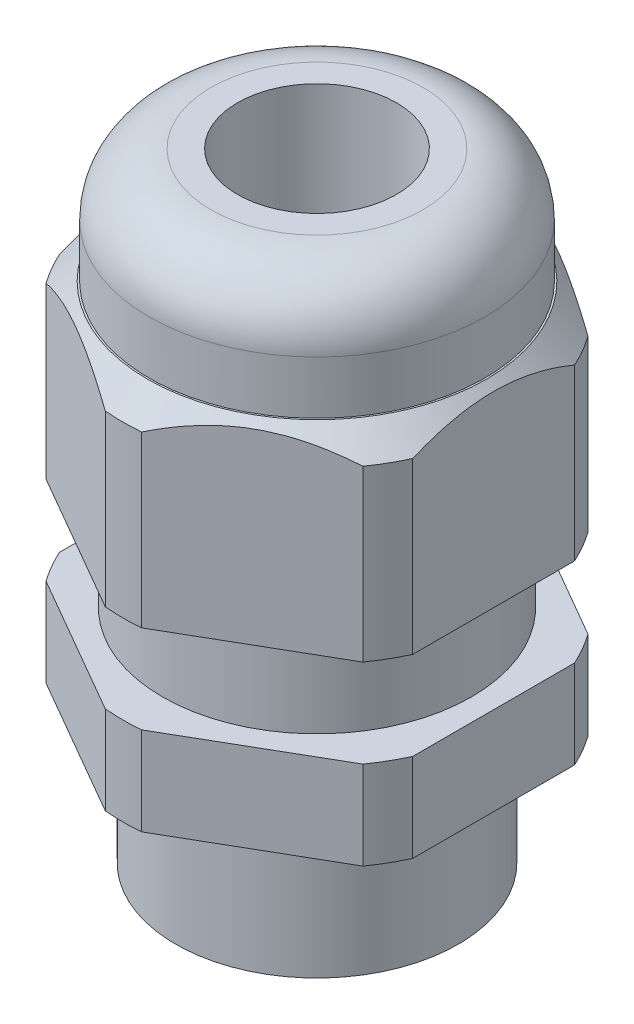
ISO-10303-21;
HEADER;
FILE_DESCRIPTION(('STEP AP214'),'2;1');
FILE_NAME('part.step','',(''),(''),'','','');
FILE_SCHEMA(('AUTOMOTIVE_DESIGN { 1 0 10303 214 1 1 1 1 }'));
ENDSEC;
DATA;
#1=APPLICATION_CONTEXT('core data for automotive mechanical design processes');
#2=APPLICATION_PROTOCOL_DEFINITION('international standard','automotive_design',2000,#1);
#3=PRODUCT_CONTEXT('',#1,'mechanical');
#4=PRODUCT('Part','Part','',(#3));
#5=PRODUCT_RELATED_PRODUCT_CATEGORY('part','',(#4));
#6=PRODUCT_DEFINITION_FORMATION('','',#4);
#7=PRODUCT_DEFINITION_CONTEXT('part definition',#1,'design');
#8=PRODUCT_DEFINITION('design','',#6,#7);
#9=PRODUCT_DEFINITION_SHAPE('','',#8);
#10=(LENGTH_UNIT() NAMED_UNIT(*) SI_UNIT(.MILLI.,.METRE.));
#11=(NAMED_UNIT(*) PLANE_ANGLE_UNIT() SI_UNIT($,.RADIAN.));
#12=(NAMED_UNIT(*) SI_UNIT($,.STERADIAN.) SOLID_ANGLE_UNIT());
#13=UNCERTAINTY_MEASURE_WITH_UNIT(LENGTH_MEASURE(1.E-05),#10,'distance_accuracy_value','');
#14=(GEOMETRIC_REPRESENTATION_CONTEXT(3) GLOBAL_UNCERTAINTY_ASSIGNED_CONTEXT((#13)) GLOBAL_UNIT_ASSIGNED_CONTEXT((#10,
#11,#12)) REPRESENTATION_CONTEXT('',''));
#15=CARTESIAN_POINT('',(0.,0.,0.));
#16=DIRECTION('',(0.,0.,1.));
#17=DIRECTION('',(1.,0.,0.));
#18=AXIS2_PLACEMENT_3D('',#15,#16,#17);
#19=CARTESIAN_POINT('',(0.,0.,0.));
#20=DIRECTION('',(0.,-0.999999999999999,0.));
#21=DIRECTION('',(0.,0.,-1.));
#22=AXIS2_PLACEMENT_3D('',#19,#20,#21);
#23=CYLINDRICAL_SURFACE('',#22,11.);
#24=CARTESIAN_POINT('',(1.94289029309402E-13,17.5,0.));
#25=DIRECTION('',(0.,-0.999999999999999,0.));
#26=DIRECTION('',(0.,0.,-1.));
#27=AXIS2_PLACEMENT_3D('',#24,#25,#26);
#28=CIRCLE('',#27,11.);
#29=CARTESIAN_POINT('',(1.03137303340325,17.5,10.9515418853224));
#30=VERTEX_POINT('',#29);
#31=CARTESIAN_POINT('',(-1.03137303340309,17.5,10.9515418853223));
#32=VERTEX_POINT('',#31);
#33=EDGE_CURVE('E350',#30,#32,#28,.T.);
#34=ORIENTED_EDGE('',*,*,#33,.F.);
#35=DIRECTION('',(0.,-0.999999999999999,0.));
#36=VECTOR('',#35,1.);
#37=CARTESIAN_POINT('',(1.0313730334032,0.,10.9515418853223));
#38=LINE('',#37,#36);
#39=CARTESIAN_POINT('',(1.03137303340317,27.1,10.9515418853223));
#40=VERTEX_POINT('',#39);
#41=EDGE_CURVE('E394',#30,#40,#38,.F.);
#42=ORIENTED_EDGE('',*,*,#41,.T.);
#43=CARTESIAN_POINT('',(0.,27.1000000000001,0.));
#44=DIRECTION('',(0.,0.999999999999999,0.));
#45=DIRECTION('',(0.,0.,1.));
#46=AXIS2_PLACEMENT_3D('',#43,#44,#45);
#47=CIRCLE('',#46,11.);
#48=CARTESIAN_POINT('',(-1.03137303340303,27.1,10.9515418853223));
#49=VERTEX_POINT('',#48);
#50=EDGE_CURVE('E232',#40,#49,#47,.F.);
#51=ORIENTED_EDGE('',*,*,#50,.T.);
#52=DIRECTION('',(0.,-0.999999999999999,0.));
#53=VECTOR('',#52,1.);
#54=CARTESIAN_POINT('',(-1.03137303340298,0.,10.9515418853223));
#55=LINE('',#54,#53);
#56=EDGE_CURVE('E417',#49,#32,#55,.T.);
#57=ORIENTED_EDGE('',*,*,#56,.T.);
#58=EDGE_LOOP('',(#34,#42,#51,#57));
#59=FACE_BOUND('',#58,.T.);
#60=ADVANCED_FACE('F39',(#59),#23,.T.);
#61=CARTESIAN_POINT('',(10.0000000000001,27.1,4.58257569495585));
#62=VERTEX_POINT('',#61);
#63=CARTESIAN_POINT('',(8.968626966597,27.0999999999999,6.36896619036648));
#64=VERTEX_POINT('',#63);
#65=EDGE_CURVE('E224',#62,#64,#47,.F.);
#66=ORIENTED_EDGE('',*,*,#65,.T.);
#67=DIRECTION('',(0.,-0.999999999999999,0.));
#68=VECTOR('',#67,1.);
#69=CARTESIAN_POINT('',(8.96862696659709,0.,6.36896619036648));
#70=LINE('',#69,#68);
#71=CARTESIAN_POINT('',(8.96862696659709,17.4999999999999,6.36896619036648));
#72=VERTEX_POINT('',#71);
#73=EDGE_CURVE('E397',#64,#72,#70,.T.);
#74=ORIENTED_EDGE('',*,*,#73,.T.);
#75=CARTESIAN_POINT('',(10.0000000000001,17.5000000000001,4.58257569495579));
#76=VERTEX_POINT('',#75);
#77=EDGE_CURVE('E226',#76,#72,#28,.T.);
#78=ORIENTED_EDGE('',*,*,#77,.F.);
#79=DIRECTION('',(0.,-0.999999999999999,0.));
#80=VECTOR('',#79,1.);
#81=CARTESIAN_POINT('',(10.0000000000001,1.80411241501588E-13,4.58257569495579));
#82=LINE('',#81,#80);
#83=EDGE_CURVE('E208',#76,#62,#82,.F.);
#84=ORIENTED_EDGE('',*,*,#83,.T.);
#85=EDGE_LOOP('',(#66,#74,#78,#84));
#86=FACE_BOUND('',#85,.T.);
#87=ADVANCED_FACE('F222',(#86),#23,.T.);
#88=CARTESIAN_POINT('',(-8.96862696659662,17.5000000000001,6.36896619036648));
#89=VERTEX_POINT('',#88);
#90=CARTESIAN_POINT('',(-9.99999999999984,17.5,4.58257569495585));
#91=VERTEX_POINT('',#90);
#92=EDGE_CURVE('E358',#89,#91,#28,.T.);
#93=ORIENTED_EDGE('',*,*,#92,.F.);
#94=DIRECTION('',(0.,-0.999999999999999,0.));
#95=VECTOR('',#94,1.);
#96=CARTESIAN_POINT('',(-8.96862696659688,1.2490009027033E-13,6.36896619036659));
#97=LINE('',#96,#95);
#98=CARTESIAN_POINT('',(-8.96862696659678,27.1000000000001,6.36896619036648));
#99=VERTEX_POINT('',#98);
#100=EDGE_CURVE('E414',#89,#99,#97,.F.);
#101=ORIENTED_EDGE('',*,*,#100,.T.);
#102=CARTESIAN_POINT('',(-9.99999999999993,27.1,4.58257569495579));
#103=VERTEX_POINT('',#102);
#104=EDGE_CURVE('E237',#99,#103,#47,.F.);
#105=ORIENTED_EDGE('',*,*,#104,.T.);
#106=DIRECTION('',(0.,-0.999999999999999,0.));
#107=VECTOR('',#106,1.);
#108=CARTESIAN_POINT('',(-9.99999999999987,0.,4.58257569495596));
#109=LINE('',#108,#107);
#110=EDGE_CURVE('E435',#103,#91,#109,.T.);
#111=ORIENTED_EDGE('',*,*,#110,.T.);
#112=EDGE_LOOP('',(#93,#101,#105,#111));
#113=FACE_BOUND('',#112,.T.);
#114=ADVANCED_FACE('F321',(#113),#23,.T.);
#115=CARTESIAN_POINT('',(-9.99999999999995,17.5000000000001,-4.58257569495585));
#116=VERTEX_POINT('',#115);
#117=CARTESIAN_POINT('',(-8.96862696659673,17.5000000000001,-6.36896619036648));
#118=VERTEX_POINT('',#117);
#119=EDGE_CURVE('E353',#116,#118,#28,.T.);
#120=ORIENTED_EDGE('',*,*,#119,.F.);
#121=DIRECTION('',(0.,-0.999999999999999,0.));
#122=VECTOR('',#121,1.);
#123=CARTESIAN_POINT('',(-9.99999999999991,0.,-4.58257569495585));
#124=LINE('',#123,#122);
#125=CARTESIAN_POINT('',(-9.99999999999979,27.1,-4.58257569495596));
#126=VERTEX_POINT('',#125);
#127=EDGE_CURVE('E432',#116,#126,#124,.F.);
#128=ORIENTED_EDGE('',*,*,#127,.T.);
#129=CARTESIAN_POINT('',(-8.96862696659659,27.0999999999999,-6.36896619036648));
#130=VERTEX_POINT('',#129);
#131=EDGE_CURVE('E498',#126,#130,#47,.F.);
#132=ORIENTED_EDGE('',*,*,#131,.T.);
#133=DIRECTION('',(0.,-0.999999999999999,0.));
#134=VECTOR('',#133,1.);
#135=CARTESIAN_POINT('',(-8.96862696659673,1.2490009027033E-13,-6.36896619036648));
#136=LINE('',#135,#134);
#137=EDGE_CURVE('E452',#130,#118,#136,.T.);
#138=ORIENTED_EDGE('',*,*,#137,.T.);
#139=EDGE_LOOP('',(#120,#128,#132,#138));
#140=FACE_BOUND('',#139,.T.);
#141=ADVANCED_FACE('F335',(#140),#23,.T.);
#142=CARTESIAN_POINT('',(-1.03137303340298,17.5000000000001,-10.9515418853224));
#143=VERTEX_POINT('',#142);
#144=CARTESIAN_POINT('',(1.03137303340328,17.5000000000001,-10.9515418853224));
#145=VERTEX_POINT('',#144);
#146=EDGE_CURVE('E346',#143,#145,#28,.T.);
#147=ORIENTED_EDGE('',*,*,#146,.F.);
#148=DIRECTION('',(0.,-0.999999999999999,0.));
#149=VECTOR('',#148,1.);
#150=CARTESIAN_POINT('',(-1.03137303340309,0.,-10.9515418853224));
#151=LINE('',#150,#149);
#152=CARTESIAN_POINT('',(-1.03137303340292,27.1,-10.9515418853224));
#153=VERTEX_POINT('',#152);
#154=EDGE_CURVE('E449',#143,#153,#151,.F.);
#155=ORIENTED_EDGE('',*,*,#154,.T.);
#156=CARTESIAN_POINT('',(1.0313730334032,27.1,-10.9515418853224));
#157=VERTEX_POINT('',#156);
#158=EDGE_CURVE('E234',#153,#157,#47,.F.);
#159=ORIENTED_EDGE('',*,*,#158,.T.);
#160=DIRECTION('',(0.,-0.999999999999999,0.));
#161=VECTOR('',#160,1.);
#162=CARTESIAN_POINT('',(1.03137303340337,0.,-10.9515418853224));
#163=LINE('',#162,#161);
#164=EDGE_CURVE('E470',#157,#145,#163,.T.);
#165=ORIENTED_EDGE('',*,*,#164,.T.);
#166=EDGE_LOOP('',(#147,#155,#159,#165));
#167=FACE_BOUND('',#166,.T.);
#168=ADVANCED_FACE('F327',(#167),#23,.T.);
#169=CARTESIAN_POINT('',(8.96862696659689,17.5,-6.36896619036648));
#170=VERTEX_POINT('',#169);
#171=CARTESIAN_POINT('',(10.0000000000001,17.5,-4.58257569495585));
#172=VERTEX_POINT('',#171);
#173=EDGE_CURVE('E340',#170,#172,#28,.T.);
#174=ORIENTED_EDGE('',*,*,#173,.F.);
#175=DIRECTION('',(0.,-0.999999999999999,0.));
#176=VECTOR('',#175,1.);
#177=CARTESIAN_POINT('',(8.96862696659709,0.,-6.36896619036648));
#178=LINE('',#177,#176);
#179=CARTESIAN_POINT('',(8.96862696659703,27.1,-6.36896619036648));
#180=VERTEX_POINT('',#179);
#181=EDGE_CURVE('E341',#170,#180,#178,.F.);
#182=ORIENTED_EDGE('',*,*,#181,.T.);
#183=CARTESIAN_POINT('',(10.,27.0999999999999,-4.58257569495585));
#184=VERTEX_POINT('',#183);
#185=EDGE_CURVE('E231',#180,#184,#47,.F.);
#186=ORIENTED_EDGE('',*,*,#185,.T.);
#187=DIRECTION('',(0.,-0.999999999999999,0.));
#188=VECTOR('',#187,1.);
#189=CARTESIAN_POINT('',(10.0000000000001,0.,-4.58257569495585));
#190=LINE('',#189,#188);
#191=EDGE_CURVE('E211',#184,#172,#190,.T.);
#192=ORIENTED_EDGE('',*,*,#191,.T.);
#193=EDGE_LOOP('',(#174,#182,#186,#192));
#194=FACE_BOUND('',#193,.T.);
#195=ADVANCED_FACE('F317',(#194),#23,.T.);
#196=CARTESIAN_POINT('',(8.75000000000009,17.5000000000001,0.));
#197=DIRECTION('',(0.,-0.999999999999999,0.));
#198=DIRECTION('',(0.,0.,-1.));
#199=AXIS2_PLACEMENT_3D('',#196,#197,#198);
#200=PLANE('',#199);
#201=CARTESIAN_POINT('',(1.94289029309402E-13,17.5,0.));
#202=DIRECTION('',(0.,-0.999999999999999,0.));
#203=DIRECTION('',(0.,0.,-1.));
#204=AXIS2_PLACEMENT_3D('',#201,#202,#203);
#205=CIRCLE('',#204,8.75);
#206=CARTESIAN_POINT('',(0.,17.5,-8.75));
#207=VERTEX_POINT('',#206);
#208=EDGE_CURVE('E354',#207,#207,#205,.T.);
#209=ORIENTED_EDGE('',*,*,#208,.F.);
#210=EDGE_LOOP('',(#209));
#211=FACE_BOUND('',#210,.T.);
#212=ORIENTED_EDGE('',*,*,#77,.T.);
#213=DIRECTION('',(-0.866025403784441,0.,0.500000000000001));
#214=VECTOR('',#213,1.);
#215=CARTESIAN_POINT('',(11.5625000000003,17.5000000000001,4.87139289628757));
#216=LINE('',#215,#214);
#217=EDGE_CURVE('E391',#72,#30,#216,.T.);
#218=ORIENTED_EDGE('',*,*,#217,.T.);
#219=ORIENTED_EDGE('',*,*,#33,.T.);
#220=DIRECTION('',(-0.866025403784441,0.,-0.500000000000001));
#221=VECTOR('',#220,1.);
#222=CARTESIAN_POINT('',(1.56250000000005,17.5,12.4491151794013));
#223=LINE('',#222,#221);
#224=EDGE_CURVE('E411',#32,#89,#223,.T.);
#225=ORIENTED_EDGE('',*,*,#224,.T.);
#226=ORIENTED_EDGE('',*,*,#92,.T.);
#227=DIRECTION('',(0.,0.,-1.));
#228=VECTOR('',#227,1.);
#229=CARTESIAN_POINT('',(-9.99999999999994,17.4999999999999,0.));
#230=LINE('',#229,#228);
#231=EDGE_CURVE('E429',#91,#116,#230,.T.);
#232=ORIENTED_EDGE('',*,*,#231,.T.);
#233=ORIENTED_EDGE('',*,*,#119,.T.);
#234=DIRECTION('',(0.866025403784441,0.,-0.500000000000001));
#235=VECTOR('',#234,1.);
#236=CARTESIAN_POINT('',(1.56249999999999,17.5,-12.4491151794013));
#237=LINE('',#236,#235);
#238=EDGE_CURVE('E447',#118,#143,#237,.T.);
#239=ORIENTED_EDGE('',*,*,#238,.T.);
#240=ORIENTED_EDGE('',*,*,#146,.T.);
#241=DIRECTION('',(0.866025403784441,0.,0.500000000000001));
#242=VECTOR('',#241,1.);
#243=CARTESIAN_POINT('',(11.5625000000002,17.5,-4.87139289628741));
#244=LINE('',#243,#242);
#245=EDGE_CURVE('E467',#145,#170,#244,.T.);
#246=ORIENTED_EDGE('',*,*,#245,.T.);
#247=ORIENTED_EDGE('',*,*,#173,.T.);
#248=DIRECTION('',(0.,0.,1.));
#249=VECTOR('',#248,1.);
#250=CARTESIAN_POINT('',(10.0000000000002,17.5000000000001,0.));
#251=LINE('',#250,#249);
#252=EDGE_CURVE('E227',#172,#76,#251,.T.);
#253=ORIENTED_EDGE('',*,*,#252,.T.);
#254=EDGE_LOOP('',(#212,#218,#219,#225,#226,#232,#233,#239,#240,#246,#247,#253));
#255=FACE_BOUND('',#254,.T.);
#256=ADVANCED_FACE('F326',(#211,#255),#200,.T.);
#257=CARTESIAN_POINT('',(11.0000000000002,12.5000000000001,0.));
#258=DIRECTION('',(0.,0.999999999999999,0.));
#259=DIRECTION('',(0.,0.,1.));
#260=AXIS2_PLACEMENT_3D('',#257,#258,#259);
#261=PLANE('',#260);
#262=CARTESIAN_POINT('',(2.4980018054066E-13,12.5,0.));
#263=DIRECTION('',(0.,-0.999999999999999,0.));
#264=DIRECTION('',(0.,0.,-1.));
#265=AXIS2_PLACEMENT_3D('',#262,#263,#264);
#266=CIRCLE('',#265,8.75);
#267=CARTESIAN_POINT('',(0.,12.5,-8.75));
#268=VERTEX_POINT('',#267);
#269=EDGE_CURVE('E360',#268,#268,#266,.T.);
#270=ORIENTED_EDGE('',*,*,#269,.T.);
#271=EDGE_LOOP('',(#270));
#272=FACE_BOUND('',#271,.T.);
#273=CARTESIAN_POINT('',(2.4980018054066E-13,12.5,0.));
#274=DIRECTION('',(0.,-0.999999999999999,0.));
#275=DIRECTION('',(0.,0.,-1.));
#276=AXIS2_PLACEMENT_3D('',#273,#274,#275);
#277=CIRCLE('',#276,11.);
#278=CARTESIAN_POINT('',(1.03137303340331,12.5,10.9515418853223));
#279=VERTEX_POINT('',#278);
#280=CARTESIAN_POINT('',(-1.03137303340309,12.5000000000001,10.9515418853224));
#281=VERTEX_POINT('',#280);
#282=EDGE_CURVE('E636',#279,#281,#277,.T.);
#283=ORIENTED_EDGE('',*,*,#282,.F.);
#284=DIRECTION('',(0.866025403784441,0.,-0.500000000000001));
#285=VECTOR('',#284,1.);
#286=CARTESIAN_POINT('',(13.2500000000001,12.5,3.89711431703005));
#287=LINE('',#286,#285);
#288=CARTESIAN_POINT('',(8.96862696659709,12.5,6.36896619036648));
#289=VERTEX_POINT('',#288);
#290=EDGE_CURVE('E379',#279,#289,#287,.T.);
#291=ORIENTED_EDGE('',*,*,#290,.T.);
#292=CARTESIAN_POINT('',(10.0000000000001,12.5,4.58257569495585));
#293=VERTEX_POINT('',#292);
#294=EDGE_CURVE('E634',#293,#289,#277,.T.);
#295=ORIENTED_EDGE('',*,*,#294,.F.);
#296=DIRECTION('',(0.,0.,-1.));
#297=VECTOR('',#296,1.);
#298=CARTESIAN_POINT('',(10.0000000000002,12.5000000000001,0.));
#299=LINE('',#298,#297);
#300=CARTESIAN_POINT('',(10.0000000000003,12.5,-4.58257569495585));
#301=VERTEX_POINT('',#300);
#302=EDGE_CURVE('E473',#293,#301,#299,.T.);
#303=ORIENTED_EDGE('',*,*,#302,.T.);
#304=CARTESIAN_POINT('',(8.96862696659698,12.4999999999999,-6.36896619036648));
#305=VERTEX_POINT('',#304);
#306=EDGE_CURVE('E364',#305,#301,#277,.T.);
#307=ORIENTED_EDGE('',*,*,#306,.F.);
#308=DIRECTION('',(-0.866025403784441,0.,-0.500000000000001));
#309=VECTOR('',#308,1.);
#310=CARTESIAN_POINT('',(13.2500000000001,12.5000000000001,-3.8971143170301));
#311=LINE('',#310,#309);
#312=CARTESIAN_POINT('',(1.03137303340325,12.5000000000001,-10.9515418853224));
#313=VERTEX_POINT('',#312);
#314=EDGE_CURVE('E455',#305,#313,#311,.T.);
#315=ORIENTED_EDGE('',*,*,#314,.T.);
#316=CARTESIAN_POINT('',(-1.03137303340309,12.4999999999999,-10.9515418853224));
#317=VERTEX_POINT('',#316);
#318=EDGE_CURVE('E367',#317,#313,#277,.T.);
#319=ORIENTED_EDGE('',*,*,#318,.F.);
#320=DIRECTION('',(-0.866025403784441,0.,0.500000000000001));
#321=VECTOR('',#320,1.);
#322=CARTESIAN_POINT('',(3.2500000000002,12.5000000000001,-13.4233937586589));
#323=LINE('',#322,#321);
#324=CARTESIAN_POINT('',(-8.96862696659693,12.5,-6.36896619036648));
#325=VERTEX_POINT('',#324);
#326=EDGE_CURVE('E438',#317,#325,#323,.T.);
#327=ORIENTED_EDGE('',*,*,#326,.T.);
#328=CARTESIAN_POINT('',(-9.99999999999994,12.5,-4.58257569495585));
#329=VERTEX_POINT('',#328);
#330=EDGE_CURVE('E370',#329,#325,#277,.T.);
#331=ORIENTED_EDGE('',*,*,#330,.F.);
#332=DIRECTION('',(0.,0.,1.));
#333=VECTOR('',#332,1.);
#334=CARTESIAN_POINT('',(-9.99999999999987,12.5000000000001,0.));
#335=LINE('',#334,#333);
#336=CARTESIAN_POINT('',(-9.9999999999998,12.5000000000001,4.58257569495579));
#337=VERTEX_POINT('',#336);
#338=EDGE_CURVE('E420',#329,#337,#335,.T.);
#339=ORIENTED_EDGE('',*,*,#338,.T.);
#340=CARTESIAN_POINT('',(-8.96862696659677,12.5000000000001,6.36896619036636));
#341=VERTEX_POINT('',#340);
#342=EDGE_CURVE('E637',#341,#337,#277,.T.);
#343=ORIENTED_EDGE('',*,*,#342,.F.);
#344=DIRECTION('',(0.866025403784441,0.,0.500000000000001));
#345=VECTOR('',#344,1.);
#346=CARTESIAN_POINT('',(3.25000000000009,12.5000000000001,13.4233937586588));
#347=LINE('',#346,#345);
#348=EDGE_CURVE('E399',#341,#281,#347,.T.);
#349=ORIENTED_EDGE('',*,*,#348,.T.);
#350=EDGE_LOOP('',(#283,#291,#295,#303,#307,#315,#319,#327,#331,#339,#343,#349));
#351=FACE_BOUND('',#350,.T.);
#352=ADVANCED_FACE('F333',(#272,#351),#261,.T.);
#353=CARTESIAN_POINT('',(0.,0.,0.));
#354=DIRECTION('',(0.,-0.999999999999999,0.));
#355=DIRECTION('',(0.,0.,-1.));
#356=AXIS2_PLACEMENT_3D('',#353,#354,#355);
#357=CYLINDRICAL_SURFACE('',#356,11.);
#358=CARTESIAN_POINT('',(1.38777878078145E-13,7.50000000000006,0.));
#359=DIRECTION('',(0.,-0.999999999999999,0.));
#360=DIRECTION('',(0.,0.,-1.));
#361=AXIS2_PLACEMENT_3D('',#358,#359,#360);
#362=CIRCLE('',#361,11.);
#363=CARTESIAN_POINT('',(1.03137303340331,7.50000000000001,10.9515418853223));
#364=VERTEX_POINT('',#363);
#365=CARTESIAN_POINT('',(-1.03137303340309,7.50000000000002,10.9515418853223));
#366=VERTEX_POINT('',#365);
#367=EDGE_CURVE('E608',#364,#366,#362,.T.);
#368=ORIENTED_EDGE('',*,*,#367,.F.);
#369=DIRECTION('',(0.,-0.999999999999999,0.));
#370=VECTOR('',#369,1.);
#371=CARTESIAN_POINT('',(1.0313730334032,0.,10.9515418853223));
#372=LINE('',#371,#370);
#373=EDGE_CURVE('E382',#364,#279,#372,.F.);
#374=ORIENTED_EDGE('',*,*,#373,.T.);
#375=ORIENTED_EDGE('',*,*,#282,.T.);
#376=DIRECTION('',(0.,-0.999999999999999,0.));
#377=VECTOR('',#376,1.);
#378=CARTESIAN_POINT('',(-1.03137303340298,0.,10.9515418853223));
#379=LINE('',#378,#377);
#380=EDGE_CURVE('E405',#281,#366,#379,.T.);
#381=ORIENTED_EDGE('',*,*,#380,.T.);
#382=EDGE_LOOP('',(#368,#374,#375,#381));
#383=FACE_BOUND('',#382,.T.);
#384=ADVANCED_FACE('F611',(#383),#357,.T.);
#385=ORIENTED_EDGE('',*,*,#294,.T.);
#386=DIRECTION('',(0.,-0.999999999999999,0.));
#387=VECTOR('',#386,1.);
#388=CARTESIAN_POINT('',(8.96862696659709,0.,6.36896619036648));
#389=LINE('',#388,#387);
#390=CARTESIAN_POINT('',(8.96862696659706,7.50000000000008,6.36896619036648));
#391=VERTEX_POINT('',#390);
#392=EDGE_CURVE('E385',#289,#391,#389,.T.);
#393=ORIENTED_EDGE('',*,*,#392,.T.);
#394=CARTESIAN_POINT('',(10.0000000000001,7.50000000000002,4.58257569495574));
#395=VERTEX_POINT('',#394);
#396=EDGE_CURVE('E610',#395,#391,#362,.T.);
#397=ORIENTED_EDGE('',*,*,#396,.F.);
#398=DIRECTION('',(0.,-0.999999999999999,0.));
#399=VECTOR('',#398,1.);
#400=CARTESIAN_POINT('',(10.0000000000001,1.80411241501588E-13,4.58257569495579));
#401=LINE('',#400,#399);
#402=EDGE_CURVE('E476',#395,#293,#401,.F.);
#403=ORIENTED_EDGE('',*,*,#402,.T.);
#404=EDGE_LOOP('',(#385,#393,#397,#403));
#405=FACE_BOUND('',#404,.T.);
#406=ADVANCED_FACE('F643',(#405),#357,.T.);
#407=CARTESIAN_POINT('',(-8.96862696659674,7.50000000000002,6.36896619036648));
#408=VERTEX_POINT('',#407);
#409=CARTESIAN_POINT('',(-9.99999999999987,7.50000000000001,4.58257569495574));
#410=VERTEX_POINT('',#409);
#411=EDGE_CURVE('E612',#408,#410,#362,.T.);
#412=ORIENTED_EDGE('',*,*,#411,.F.);
#413=DIRECTION('',(0.,-0.999999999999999,0.));
#414=VECTOR('',#413,1.);
#415=CARTESIAN_POINT('',(-8.96862696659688,1.2490009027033E-13,6.36896619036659));
#416=LINE('',#415,#414);
#417=EDGE_CURVE('E402',#408,#341,#416,.F.);
#418=ORIENTED_EDGE('',*,*,#417,.T.);
#419=ORIENTED_EDGE('',*,*,#342,.T.);
#420=DIRECTION('',(0.,-0.999999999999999,0.));
#421=VECTOR('',#420,1.);
#422=CARTESIAN_POINT('',(-9.99999999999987,0.,4.58257569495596));
#423=LINE('',#422,#421);
#424=EDGE_CURVE('E424',#337,#410,#423,.T.);
#425=ORIENTED_EDGE('',*,*,#424,.T.);
#426=EDGE_LOOP('',(#412,#418,#419,#425));
#427=FACE_BOUND('',#426,.T.);
#428=ADVANCED_FACE('F641',(#427),#357,.T.);
#429=CARTESIAN_POINT('',(-10.,7.50000000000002,-4.58257569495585));
#430=VERTEX_POINT('',#429);
#431=CARTESIAN_POINT('',(-8.96862696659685,7.49999999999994,-6.36896619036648));
#432=VERTEX_POINT('',#431);
#433=EDGE_CURVE('E375',#430,#432,#362,.T.);
#434=ORIENTED_EDGE('',*,*,#433,.F.);
#435=DIRECTION('',(0.,-0.999999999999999,0.));
#436=VECTOR('',#435,1.);
#437=CARTESIAN_POINT('',(-9.99999999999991,0.,-4.58257569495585));
#438=LINE('',#437,#436);
#439=EDGE_CURVE('E68',#430,#329,#438,.F.);
#440=ORIENTED_EDGE('',*,*,#439,.T.);
#441=ORIENTED_EDGE('',*,*,#330,.T.);
#442=DIRECTION('',(0.,-0.999999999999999,0.));
#443=VECTOR('',#442,1.);
#444=CARTESIAN_POINT('',(-8.96862696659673,1.2490009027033E-13,-6.36896619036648));
#445=LINE('',#444,#443);
#446=EDGE_CURVE('E442',#325,#432,#445,.T.);
#447=ORIENTED_EDGE('',*,*,#446,.T.);
#448=EDGE_LOOP('',(#434,#440,#441,#447));
#449=FACE_BOUND('',#448,.T.);
#450=ADVANCED_FACE('F619',(#449),#357,.T.);
#451=CARTESIAN_POINT('',(-1.03137303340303,7.49999999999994,-10.9515418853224));
#452=VERTEX_POINT('',#451);
#453=CARTESIAN_POINT('',(1.03137303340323,7.50000000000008,-10.9515418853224));
#454=VERTEX_POINT('',#453);
#455=EDGE_CURVE('E372',#452,#454,#362,.T.);
#456=ORIENTED_EDGE('',*,*,#455,.F.);
#457=DIRECTION('',(0.,-0.999999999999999,0.));
#458=VECTOR('',#457,1.);
#459=CARTESIAN_POINT('',(-1.03137303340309,0.,-10.9515418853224));
#460=LINE('',#459,#458);
#461=EDGE_CURVE('E60',#452,#317,#460,.F.);
#462=ORIENTED_EDGE('',*,*,#461,.T.);
#463=ORIENTED_EDGE('',*,*,#318,.T.);
#464=DIRECTION('',(0.,-0.999999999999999,0.));
#465=VECTOR('',#464,1.);
#466=CARTESIAN_POINT('',(1.03137303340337,0.,-10.9515418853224));
#467=LINE('',#466,#465);
#468=EDGE_CURVE('E461',#313,#454,#467,.T.);
#469=ORIENTED_EDGE('',*,*,#468,.T.);
#470=EDGE_LOOP('',(#456,#462,#463,#469));
#471=FACE_BOUND('',#470,.T.);
#472=ADVANCED_FACE('F626',(#471),#357,.T.);
#473=CARTESIAN_POINT('',(8.96862696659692,7.50000000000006,-6.36896619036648));
#474=VERTEX_POINT('',#473);
#475=CARTESIAN_POINT('',(10.0000000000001,7.50000000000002,-4.58257569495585));
#476=VERTEX_POINT('',#475);
#477=EDGE_CURVE('E371',#474,#476,#362,.T.);
#478=ORIENTED_EDGE('',*,*,#477,.F.);
#479=DIRECTION('',(0.,-0.999999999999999,0.));
#480=VECTOR('',#479,1.);
#481=CARTESIAN_POINT('',(8.96862696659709,0.,-6.36896619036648));
#482=LINE('',#481,#480);
#483=EDGE_CURVE('E458',#474,#305,#482,.F.);
#484=ORIENTED_EDGE('',*,*,#483,.T.);
#485=ORIENTED_EDGE('',*,*,#306,.T.);
#486=DIRECTION('',(0.,-0.999999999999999,0.));
#487=VECTOR('',#486,1.);
#488=CARTESIAN_POINT('',(10.0000000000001,0.,-4.58257569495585));
#489=LINE('',#488,#487);
#490=EDGE_CURVE('E479',#301,#476,#489,.T.);
#491=ORIENTED_EDGE('',*,*,#490,.T.);
#492=EDGE_LOOP('',(#478,#484,#485,#491));
#493=FACE_BOUND('',#492,.T.);
#494=ADVANCED_FACE('F630',(#493),#357,.T.);
#495=CARTESIAN_POINT('',(8.00000000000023,7.50000000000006,0.));
#496=DIRECTION('',(0.,-0.999999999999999,0.));
#497=DIRECTION('',(0.,0.,-1.));
#498=AXIS2_PLACEMENT_3D('',#495,#496,#497);
#499=PLANE('',#498);
#500=CARTESIAN_POINT('',(1.38777878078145E-13,7.50000000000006,0.));
#501=DIRECTION('',(0.,-0.999999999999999,0.));
#502=DIRECTION('',(0.,0.,-1.));
#503=AXIS2_PLACEMENT_3D('',#500,#501,#502);
#504=CIRCLE('',#503,8.);
#505=CARTESIAN_POINT('',(0.,7.50000000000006,-8.));
#506=VERTEX_POINT('',#505);
#507=EDGE_CURVE('E376',#506,#506,#504,.T.);
#508=ORIENTED_EDGE('',*,*,#507,.F.);
#509=EDGE_LOOP('',(#508));
#510=FACE_BOUND('',#509,.T.);
#511=ORIENTED_EDGE('',*,*,#396,.T.);
#512=DIRECTION('',(-0.866025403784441,0.,0.500000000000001));
#513=VECTOR('',#512,1.);
#514=CARTESIAN_POINT('',(11.0000000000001,7.50000000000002,5.19615242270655));
#515=LINE('',#514,#513);
#516=EDGE_CURVE('E388',#391,#364,#515,.T.);
#517=ORIENTED_EDGE('',*,*,#516,.T.);
#518=ORIENTED_EDGE('',*,*,#367,.T.);
#519=DIRECTION('',(-0.866025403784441,0.,-0.500000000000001));
#520=VECTOR('',#519,1.);
#521=CARTESIAN_POINT('',(1.00000000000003,7.50000000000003,12.124355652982));
#522=LINE('',#521,#520);
#523=EDGE_CURVE('E408',#366,#408,#522,.T.);
#524=ORIENTED_EDGE('',*,*,#523,.T.);
#525=ORIENTED_EDGE('',*,*,#411,.T.);
#526=DIRECTION('',(0.,0.,-1.));
#527=VECTOR('',#526,1.);
#528=CARTESIAN_POINT('',(-9.99999999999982,7.50000000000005,0.));
#529=LINE('',#528,#527);
#530=EDGE_CURVE('E427',#410,#430,#529,.T.);
#531=ORIENTED_EDGE('',*,*,#530,.T.);
#532=ORIENTED_EDGE('',*,*,#433,.T.);
#533=DIRECTION('',(0.866025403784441,0.,-0.500000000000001));
#534=VECTOR('',#533,1.);
#535=CARTESIAN_POINT('',(1.00000000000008,7.50000000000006,-12.1243556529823));
#536=LINE('',#535,#534);
#537=EDGE_CURVE('E445',#432,#452,#536,.T.);
#538=ORIENTED_EDGE('',*,*,#537,.T.);
#539=ORIENTED_EDGE('',*,*,#455,.T.);
#540=DIRECTION('',(0.866025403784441,0.,0.500000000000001));
#541=VECTOR('',#540,1.);
#542=CARTESIAN_POINT('',(11.0000000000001,7.50000000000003,-5.19615242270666));
#543=LINE('',#542,#541);
#544=EDGE_CURVE('E464',#454,#474,#543,.T.);
#545=ORIENTED_EDGE('',*,*,#544,.T.);
#546=ORIENTED_EDGE('',*,*,#477,.T.);
#547=DIRECTION('',(0.,0.,1.));
#548=VECTOR('',#547,1.);
#549=CARTESIAN_POINT('',(10.0000000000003,7.49999999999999,0.));
#550=LINE('',#549,#548);
#551=EDGE_CURVE('E482',#476,#395,#550,.T.);
#552=ORIENTED_EDGE('',*,*,#551,.T.);
#553=EDGE_LOOP('',(#511,#517,#518,#524,#525,#531,#532,#538,#539,#545,#546,#552));
#554=FACE_BOUND('',#553,.T.);
#555=ADVANCED_FACE('F258',(#510,#554),#499,.T.);
#556=CARTESIAN_POINT('',(0.,27.1000000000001,0.));
#557=DIRECTION('',(0.,-0.999999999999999,0.));
#558=DIRECTION('',(0.,0.,-1.));
#559=AXIS2_PLACEMENT_3D('',#556,#557,#558);
#560=CONICAL_SURFACE('',#559,11.,0.785398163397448);
#561=CARTESIAN_POINT('',(1.11022302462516E-13,28.5000000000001,0.));
#562=DIRECTION('',(0.,0.999999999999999,0.));
#563=DIRECTION('',(0.,0.,1.));
#564=AXIS2_PLACEMENT_3D('',#561,#562,#563);
#565=CIRCLE('',#564,9.6);
#566=CARTESIAN_POINT('',(1.11821663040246E-13,28.5000000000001,9.60000000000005));
#567=VERTEX_POINT('',#566);
#568=EDGE_CURVE('E217',#567,#567,#565,.T.);
#569=ORIENTED_EDGE('',*,*,#568,.F.);
#570=EDGE_LOOP('',(#569));
#571=FACE_BOUND('',#570,.T.);
#572=ORIENTED_EDGE('',*,*,#50,.F.);
#573=CARTESIAN_POINT('',(1.03095729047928,27.0998,10.9517819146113));
#574=CARTESIAN_POINT('',(1.32338796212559,27.2404915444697,10.7829469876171));
#575=CARTESIAN_POINT('',(1.62008473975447,27.3703784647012,10.6116490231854));
#576=CARTESIAN_POINT('',(2.2222381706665,27.6033175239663,10.2639955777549));
#577=CARTESIAN_POINT('',(2.52771907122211,27.7062854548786,10.0876260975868));
#578=CARTESIAN_POINT('',(3.14280071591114,27.8783680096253,9.73250854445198));
#579=CARTESIAN_POINT('',(3.45233102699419,27.9478067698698,9.55380113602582));
#580=CARTESIAN_POINT('',(3.91977081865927,28.0240867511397,9.28392464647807));
#581=CARTESIAN_POINT('',(4.07603975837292,28.0448640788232,9.19370273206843));
#582=CARTESIAN_POINT('',(4.38930611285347,28.076783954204,9.01283831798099));
#583=CARTESIAN_POINT('',(4.54630340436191,28.087928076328,8.92219588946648));
#584=CARTESIAN_POINT('',(4.85254196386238,28.1000314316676,8.74538897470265));
#585=CARTESIAN_POINT('',(5.00176889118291,28.1014827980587,8.65923276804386));
#586=CARTESIAN_POINT('',(5.30008038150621,28.0954803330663,8.48700254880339));
#587=CARTESIAN_POINT('',(5.44916495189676,28.0880269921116,8.40092853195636));
#588=CARTESIAN_POINT('',(5.74687319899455,28.0643461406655,8.22904659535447));
#589=CARTESIAN_POINT('',(5.89549665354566,28.048114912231,8.1432388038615));
#590=CARTESIAN_POINT('',(6.19187209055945,28.0071716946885,7.9721263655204));
#591=CARTESIAN_POINT('',(6.33962395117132,27.9824585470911,7.88682178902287));
#592=CARTESIAN_POINT('',(6.7808284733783,27.8962419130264,7.63209223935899));
#593=CARTESIAN_POINT('',(7.07255000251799,27.8226343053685,7.46366673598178));
#594=CARTESIAN_POINT('',(7.64954748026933,27.6474129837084,7.13053708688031));
#595=CARTESIAN_POINT('',(7.93482196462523,27.5457929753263,6.96583378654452));
#596=CARTESIAN_POINT('',(8.34352157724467,27.3814830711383,6.72987095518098));
#597=CARTESIAN_POINT('',(8.46980958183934,27.3280539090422,6.65695854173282));
#598=CARTESIAN_POINT('',(8.72064470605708,27.2169964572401,6.51213881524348));
#599=CARTESIAN_POINT('',(8.84519529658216,27.1593786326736,6.4402294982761));
#600=CARTESIAN_POINT('',(8.9690427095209,27.0998000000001,6.36872616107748));
#601=B_SPLINE_CURVE_WITH_KNOTS('',3,(#573,#574,#575,#576,#577,#578,#579,#580,#581,#582,#583,
#584,#585,#586,#587,#588,#589,#590,#591,#592,#593,#594,#595,#596,#597,#598,#599,#600),
.UNSPECIFIED.,.F.,.F.,(4,2,2,2,2,2,2,2,2,2,2,2,2,4),(0.,1.09780785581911,2.19900986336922,
3.28934179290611,3.83403601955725,4.37864120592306,4.89536980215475,5.41206994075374,
5.92898910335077,6.44597889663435,7.47885203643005,8.51195745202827,8.97781699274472,
9.44255016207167),.UNSPECIFIED.);
#602=EDGE_CURVE('E12',#40,#64,#601,.T.);
#603=ORIENTED_EDGE('',*,*,#602,.T.);
#604=ORIENTED_EDGE('',*,*,#65,.F.);
#605=CARTESIAN_POINT('',(10.0000000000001,22.7316262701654,-11.6699147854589));
#606=CARTESIAN_POINT('',(10.0000000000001,22.9468224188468,-11.3864538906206));
#607=CARTESIAN_POINT('',(10.0000000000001,23.1599843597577,-11.1014233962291));
#608=CARTESIAN_POINT('',(10.0000000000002,23.5813235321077,-10.5275974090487));
#609=CARTESIAN_POINT('',(10.0000000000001,23.7894995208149,-10.2388010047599));
#610=CARTESIAN_POINT('',(10.0000000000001,24.201431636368,-9.65470462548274));
#611=CARTESIAN_POINT('',(10.0000000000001,24.4051410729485,-9.35937161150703));
#612=CARTESIAN_POINT('',(10.0000000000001,24.8051117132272,-8.76372014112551));
#613=CARTESIAN_POINT('',(10.0000000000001,25.0013734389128,-8.46340203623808));
#614=CARTESIAN_POINT('',(10.0000000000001,25.3960837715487,-7.83909501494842));
#615=CARTESIAN_POINT('',(10.0000000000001,25.5939790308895,-7.51475447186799));
#616=CARTESIAN_POINT('',(10.0000000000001,25.9769717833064,-6.85848677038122));
#617=CARTESIAN_POINT('',(10.0000000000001,26.1620672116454,-6.52655839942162));
#618=CARTESIAN_POINT('',(10.0000000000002,26.5154814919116,-5.85511013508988));
#619=CARTESIAN_POINT('',(10.0000000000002,26.6838496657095,-5.51561640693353));
#620=CARTESIAN_POINT('',(10.0000000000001,27.0000391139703,-4.82726832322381));
#621=CARTESIAN_POINT('',(10.0000000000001,27.1478698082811,-4.47841834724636));
#622=CARTESIAN_POINT('',(10.0000000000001,27.4060888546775,-3.80118978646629));
#623=CARTESIAN_POINT('',(10.0000000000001,27.518603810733,-3.47363048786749));
#624=CARTESIAN_POINT('',(10.0000000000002,27.7173753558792,-2.81048994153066));
#625=CARTESIAN_POINT('',(10.0000000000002,27.8036301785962,-2.47490815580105));
#626=CARTESIAN_POINT('',(10.0000000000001,27.9438946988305,-1.80338354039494));
#627=CARTESIAN_POINT('',(10.0000000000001,27.9984664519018,-1.46756007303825));
#628=CARTESIAN_POINT('',(10.0000000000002,28.0742809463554,-0.792151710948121));
#629=CARTESIAN_POINT('',(10.0000000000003,28.0955297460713,-0.452567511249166));
#630=CARTESIAN_POINT('',(10.0000000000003,28.1030513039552,0.213975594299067));
#631=CARTESIAN_POINT('',(10.0000000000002,28.0906319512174,0.540920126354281));
#632=CARTESIAN_POINT('',(10.0000000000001,28.0344258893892,1.19208383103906));
#633=CARTESIAN_POINT('',(10.0000000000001,27.9906361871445,1.51630274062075));
#634=CARTESIAN_POINT('',(10.0000000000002,27.8733592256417,2.1651531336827));
#635=CARTESIAN_POINT('',(10.0000000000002,27.7993611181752,2.48969076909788));
#636=CARTESIAN_POINT('',(10.0000000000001,27.6256599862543,3.1316745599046));
#637=CARTESIAN_POINT('',(10.0000000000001,27.5259589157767,3.44912125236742));
#638=CARTESIAN_POINT('',(10.0000000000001,27.2959739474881,4.10219320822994));
#639=CARTESIAN_POINT('',(10.0000000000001,27.1638477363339,4.43716284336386));
#640=CARTESIAN_POINT('',(10.0000000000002,26.8792679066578,5.09842966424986));
#641=CARTESIAN_POINT('',(10.0000000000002,26.7268049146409,5.42472276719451));
#642=CARTESIAN_POINT('',(10.0000000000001,26.4051747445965,6.07021365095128));
#643=CARTESIAN_POINT('',(10.0000000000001,26.2359554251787,6.38938523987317));
#644=CARTESIAN_POINT('',(10.0000000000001,25.8845476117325,7.02039380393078));
#645=CARTESIAN_POINT('',(10.0000000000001,25.7023611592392,7.33223192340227));
#646=CARTESIAN_POINT('',(10.0000000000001,25.3368639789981,7.93422615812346));
#647=CARTESIAN_POINT('',(10.0000000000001,25.1540578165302,8.2246902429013));
#648=CARTESIAN_POINT('',(10.0000000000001,24.7807267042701,8.80063043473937));
#649=CARTESIAN_POINT('',(10.0000000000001,24.5902011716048,9.08610616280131));
#650=CARTESIAN_POINT('',(10.0000000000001,24.2043765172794,9.65041361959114));
#651=CARTESIAN_POINT('',(10.0000000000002,24.009128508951,9.92928042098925));
#652=CARTESIAN_POINT('',(10.0000000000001,23.6134455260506,10.483197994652));
#653=CARTESIAN_POINT('',(10.0000000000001,23.4130119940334,10.7582497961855));
#654=CARTESIAN_POINT('',(10.0000000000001,23.2104575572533,11.0317031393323));
#655=B_SPLINE_CURVE_WITH_KNOTS('',3,(#605,#606,#607,#608,#609,#610,#611,#612,#613,#614,#615,
#616,#617,#618,#619,#620,#621,#622,#623,#624,#625,#626,#627,#628,#629,#630,#631,#632,#633,#634,
#635,#636,#637,#638,#639,#640,#641,#642,#643,#644,#645,#646,#647,#648,#649,#650,#651,#652,#653,
#654),.UNSPECIFIED.,.F.,.F.,(4,2,2,2,2,2,2,2,2,2,2,2,2,2,2,2,2,2,2,2,2,2,2,2,4),(0.,
1.06769812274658,2.13565965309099,3.21188849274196,4.2880417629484,5.42764631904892,
6.56743427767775,7.7037549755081,8.83955274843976,9.87767963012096,10.9158763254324,
11.935043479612,12.9540253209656,13.9339961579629,14.9140605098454,15.911434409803,
16.9087325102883,17.9881540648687,19.0680748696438,20.1514685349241,21.2346920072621,
22.2641541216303,23.2936941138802,24.3149017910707,25.3358283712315),.UNSPECIFIED.);
#656=EDGE_CURVE('E205',#62,#184,#655,.F.);
#657=ORIENTED_EDGE('',*,*,#656,.T.);
#658=ORIENTED_EDGE('',*,*,#185,.F.);
#659=CARTESIAN_POINT('',(8.96904270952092,27.0998,-6.36872616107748));
#660=CARTESIAN_POINT('',(8.67661203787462,27.2404915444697,-6.53756108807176));
#661=CARTESIAN_POINT('',(8.37991526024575,27.3703784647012,-6.70885905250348));
#662=CARTESIAN_POINT('',(7.7777618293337,27.6033175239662,-7.056512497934));
#663=CARTESIAN_POINT('',(7.47228092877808,27.7062854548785,-7.23288197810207));
#664=CARTESIAN_POINT('',(6.85719928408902,27.8783680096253,-7.5879995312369));
#665=CARTESIAN_POINT('',(6.54766897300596,27.9478067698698,-7.76670693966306));
#666=CARTESIAN_POINT('',(6.08022918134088,28.0240867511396,-8.03658342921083));
#667=CARTESIAN_POINT('',(5.92396024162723,28.0448640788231,-8.12680534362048));
#668=CARTESIAN_POINT('',(5.61069388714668,28.076783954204,-8.3076697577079));
#669=CARTESIAN_POINT('',(5.45369659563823,28.0879280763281,-8.39831218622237));
#670=CARTESIAN_POINT('',(5.14745803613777,28.1000314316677,-8.5751191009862));
#671=CARTESIAN_POINT('',(4.99823110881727,28.1014827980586,-8.66127530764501));
#672=CARTESIAN_POINT('',(4.69991961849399,28.0954803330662,-8.83350552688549));
#673=CARTESIAN_POINT('',(4.55083504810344,28.0880269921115,-8.9195795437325));
#674=CARTESIAN_POINT('',(4.25312680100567,28.0643461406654,-9.09146148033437));
#675=CARTESIAN_POINT('',(4.10450334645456,28.0481149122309,-9.17726927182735));
#676=CARTESIAN_POINT('',(3.80812790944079,28.0071716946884,-9.34838171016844));
#677=CARTESIAN_POINT('',(3.66037604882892,27.982458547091,-9.43368628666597));
#678=CARTESIAN_POINT('',(3.21917152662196,27.8962419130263,-9.68841583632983));
#679=CARTESIAN_POINT('',(2.92744999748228,27.8226343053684,-9.85684133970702));
#680=CARTESIAN_POINT('',(2.35045251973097,27.6474129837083,-10.1899709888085));
#681=CARTESIAN_POINT('',(2.06517803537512,27.5457929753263,-10.3546742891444));
#682=CARTESIAN_POINT('',(1.65647842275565,27.3814830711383,-10.5906371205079));
#683=CARTESIAN_POINT('',(1.53019041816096,27.3280539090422,-10.663549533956));
#684=CARTESIAN_POINT('',(1.27935529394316,27.2169964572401,-10.8083692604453));
#685=CARTESIAN_POINT('',(1.15480470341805,27.1593786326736,-10.8802785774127));
#686=CARTESIAN_POINT('',(1.03095729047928,27.0998,-10.9517819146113));
#687=B_SPLINE_CURVE_WITH_KNOTS('',3,(#659,#660,#661,#662,#663,#664,#665,#666,#667,#668,#669,
#670,#671,#672,#673,#674,#675,#676,#677,#678,#679,#680,#681,#682,#683,#684,#685,#686),
.UNSPECIFIED.,.F.,.F.,(4,2,2,2,2,2,2,2,2,2,2,2,2,4),(0.,1.09780785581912,2.19900986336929,
3.2893417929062,3.83403601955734,4.37864120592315,4.8953698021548,5.41206994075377,
5.92898910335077,6.44597889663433,7.47885203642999,8.51195745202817,8.97781699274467,
9.44255016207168),.UNSPECIFIED.);
#688=EDGE_CURVE('E216',#180,#157,#687,.T.);
#689=ORIENTED_EDGE('',*,*,#688,.T.);
#690=ORIENTED_EDGE('',*,*,#158,.F.);
#691=CARTESIAN_POINT('',(-1.03095729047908,27.0998,-10.9517819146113));
#692=CARTESIAN_POINT('',(-1.32338796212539,27.2404915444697,-10.782946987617));
#693=CARTESIAN_POINT('',(-1.62008473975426,27.3703784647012,-10.6116490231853));
#694=CARTESIAN_POINT('',(-2.22223817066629,27.6033175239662,-10.2639955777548));
#695=CARTESIAN_POINT('',(-2.52771907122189,27.7062854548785,-10.0876260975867));
#696=CARTESIAN_POINT('',(-3.14280071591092,27.8783680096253,-9.73250854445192));
#697=CARTESIAN_POINT('',(-3.45233102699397,27.9478067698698,-9.55380113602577));
#698=CARTESIAN_POINT('',(-3.91977081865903,28.0240867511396,-9.28392464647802));
#699=CARTESIAN_POINT('',(-4.07603975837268,28.0448640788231,-9.19370273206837));
#700=CARTESIAN_POINT('',(-4.38930611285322,28.076783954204,-9.01283831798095));
#701=CARTESIAN_POINT('',(-4.54630340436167,28.087928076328,-8.92219588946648));
#702=CARTESIAN_POINT('',(-4.85254196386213,28.1000314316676,-8.74538897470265));
#703=CARTESIAN_POINT('',(-5.00176889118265,28.1014827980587,-8.65923276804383));
#704=CARTESIAN_POINT('',(-5.30008038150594,28.0954803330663,-8.48700254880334));
#705=CARTESIAN_POINT('',(-5.4491649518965,28.0880269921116,-8.40092853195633));
#706=CARTESIAN_POINT('',(-5.74687319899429,28.0643461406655,-8.22904659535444));
#707=CARTESIAN_POINT('',(-5.8954966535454,28.048114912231,-8.14323880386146));
#708=CARTESIAN_POINT('',(-6.19187209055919,28.0071716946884,-7.97212636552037));
#709=CARTESIAN_POINT('',(-6.33962395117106,27.9824585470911,-7.88682178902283));
#710=CARTESIAN_POINT('',(-6.78082847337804,27.8962419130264,-7.63209223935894));
#711=CARTESIAN_POINT('',(-7.07255000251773,27.8226343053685,-7.46366673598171));
#712=CARTESIAN_POINT('',(-7.6495474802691,27.6474129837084,-7.13053708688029));
#713=CARTESIAN_POINT('',(-7.93482196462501,27.5457929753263,-6.96583378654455));
#714=CARTESIAN_POINT('',(-8.34352157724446,27.3814830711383,-6.72987095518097));
#715=CARTESIAN_POINT('',(-8.46980958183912,27.3280539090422,-6.65695854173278));
#716=CARTESIAN_POINT('',(-8.72064470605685,27.2169964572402,-6.51213881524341));
#717=CARTESIAN_POINT('',(-8.84519529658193,27.1593786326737,-6.44022949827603));
#718=CARTESIAN_POINT('',(-8.96904270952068,27.0998,-6.36872616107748));
#719=B_SPLINE_CURVE_WITH_KNOTS('',3,(#691,#692,#693,#694,#695,#696,#697,#698,#699,#700,#701,
#702,#703,#704,#705,#706,#707,#708,#709,#710,#711,#712,#713,#714,#715,#716,#717,#718),
.UNSPECIFIED.,.F.,.F.,(4,2,2,2,2,2,2,2,2,2,2,2,2,4),(0.,1.0978078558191,2.19900986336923,
3.28934179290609,3.83403601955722,4.37864120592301,4.8953698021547,5.41206994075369,
5.92898910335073,6.44597889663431,7.47885203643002,8.51195745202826,8.9778169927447,
9.44255016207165),.UNSPECIFIED.);
#720=EDGE_CURVE('E269',#153,#130,#719,.T.);
#721=ORIENTED_EDGE('',*,*,#720,.T.);
#722=ORIENTED_EDGE('',*,*,#131,.F.);
#723=CARTESIAN_POINT('',(-9.9999999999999,22.7316262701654,-11.6699147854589));
#724=CARTESIAN_POINT('',(-9.99999999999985,22.9468224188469,-11.3864538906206));
#725=CARTESIAN_POINT('',(-9.99999999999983,23.1599843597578,-11.1014233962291));
#726=CARTESIAN_POINT('',(-9.99999999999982,23.5813235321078,-10.5275974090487));
#727=CARTESIAN_POINT('',(-9.99999999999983,23.789499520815,-10.2388010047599));
#728=CARTESIAN_POINT('',(-9.99999999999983,24.2014316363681,-9.65470462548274));
#729=CARTESIAN_POINT('',(-9.99999999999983,24.4051410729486,-9.35937161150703));
#730=CARTESIAN_POINT('',(-9.99999999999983,24.8051117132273,-8.76372014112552));
#731=CARTESIAN_POINT('',(-9.99999999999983,25.0013734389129,-8.4634020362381));
#732=CARTESIAN_POINT('',(-9.99999999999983,25.3960837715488,-7.83909501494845));
#733=CARTESIAN_POINT('',(-9.99999999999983,25.5939790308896,-7.51475447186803));
#734=CARTESIAN_POINT('',(-9.99999999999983,25.9769717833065,-6.85848677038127));
#735=CARTESIAN_POINT('',(-9.99999999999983,26.1620672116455,-6.52655839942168));
#736=CARTESIAN_POINT('',(-9.99999999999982,26.5154814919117,-5.85511013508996));
#737=CARTESIAN_POINT('',(-9.99999999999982,26.6838496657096,-5.51561640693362));
#738=CARTESIAN_POINT('',(-9.99999999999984,27.0000391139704,-4.82726832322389));
#739=CARTESIAN_POINT('',(-9.99999999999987,27.1478698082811,-4.47841834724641));
#740=CARTESIAN_POINT('',(-9.99999999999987,27.4060888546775,-3.80118978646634));
#741=CARTESIAN_POINT('',(-9.99999999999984,27.5186038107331,-3.47363048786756));
#742=CARTESIAN_POINT('',(-9.99999999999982,27.7173753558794,-2.81048994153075));
#743=CARTESIAN_POINT('',(-9.99999999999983,27.8036301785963,-2.47490815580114));
#744=CARTESIAN_POINT('',(-9.99999999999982,27.9438946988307,-1.80338354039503));
#745=CARTESIAN_POINT('',(-9.9999999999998,27.998466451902,-1.46756007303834));
#746=CARTESIAN_POINT('',(-9.99999999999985,28.0742809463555,-0.7921517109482));
#747=CARTESIAN_POINT('',(-9.99999999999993,28.0955297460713,-0.452567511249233));
#748=CARTESIAN_POINT('',(-9.99999999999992,28.1030513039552,0.21397559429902));
#749=CARTESIAN_POINT('',(-9.99999999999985,28.0906319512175,0.540920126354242));
#750=CARTESIAN_POINT('',(-9.99999999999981,28.0344258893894,1.19208383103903));
#751=CARTESIAN_POINT('',(-9.99999999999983,27.9906361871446,1.51630274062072));
#752=CARTESIAN_POINT('',(-9.99999999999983,27.8733592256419,2.16515313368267));
#753=CARTESIAN_POINT('',(-9.99999999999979,27.7993611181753,2.48969076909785));
#754=CARTESIAN_POINT('',(-9.99999999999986,27.6256599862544,3.13167455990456));
#755=CARTESIAN_POINT('',(-9.99999999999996,27.5259589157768,3.44912125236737));
#756=CARTESIAN_POINT('',(-9.99999999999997,27.2959739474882,4.10219320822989));
#757=CARTESIAN_POINT('',(-9.99999999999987,27.163847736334,4.43716284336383));
#758=CARTESIAN_POINT('',(-9.99999999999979,26.8792679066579,5.09842966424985));
#759=CARTESIAN_POINT('',(-9.99999999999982,26.726804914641,5.4247227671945));
#760=CARTESIAN_POINT('',(-9.99999999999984,26.4051747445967,6.07021365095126));
#761=CARTESIAN_POINT('',(-9.99999999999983,26.2359554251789,6.38938523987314));
#762=CARTESIAN_POINT('',(-9.99999999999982,25.8845476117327,7.02039380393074));
#763=CARTESIAN_POINT('',(-9.99999999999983,25.7023611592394,7.33223192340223));
#764=CARTESIAN_POINT('',(-9.99999999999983,25.3368639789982,7.93422615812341));
#765=CARTESIAN_POINT('',(-9.99999999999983,25.1540578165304,8.22469024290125));
#766=CARTESIAN_POINT('',(-9.99999999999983,24.7807267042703,8.80063043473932));
#767=CARTESIAN_POINT('',(-9.99999999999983,24.5902011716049,9.08610616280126));
#768=CARTESIAN_POINT('',(-9.99999999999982,24.2043765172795,9.6504136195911));
#769=CARTESIAN_POINT('',(-9.99999999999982,24.0091285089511,9.92928042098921));
#770=CARTESIAN_POINT('',(-9.99999999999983,23.6134455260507,10.483197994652));
#771=CARTESIAN_POINT('',(-9.99999999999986,23.4130119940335,10.7582497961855));
#772=CARTESIAN_POINT('',(-9.99999999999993,23.2104575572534,11.0317031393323));
#773=B_SPLINE_CURVE_WITH_KNOTS('',3,(#723,#724,#725,#726,#727,#728,#729,#730,#731,#732,#733,
#734,#735,#736,#737,#738,#739,#740,#741,#742,#743,#744,#745,#746,#747,#748,#749,#750,#751,#752,
#753,#754,#755,#756,#757,#758,#759,#760,#761,#762,#763,#764,#765,#766,#767,#768,#769,#770,#771,
#772),.UNSPECIFIED.,.F.,.F.,(4,2,2,2,2,2,2,2,2,2,2,2,2,2,2,2,2,2,2,2,2,2,2,2,4),(0.,
1.06769812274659,2.13565965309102,3.21188849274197,4.28804176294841,5.4276463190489,
6.5674342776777,7.70375497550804,8.8395527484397,9.87767963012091,10.9158763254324,
11.935043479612,12.9540253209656,13.9339961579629,14.9140605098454,15.9114344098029,
16.9087325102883,17.9881540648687,19.0680748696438,20.1514685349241,21.2346920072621,
22.2641541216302,23.2936941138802,24.3149017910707,25.3358283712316),.UNSPECIFIED.);
#774=EDGE_CURVE('E276',#126,#103,#773,.T.);
#775=ORIENTED_EDGE('',*,*,#774,.T.);
#776=ORIENTED_EDGE('',*,*,#104,.F.);
#777=CARTESIAN_POINT('',(-8.96904270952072,27.0998,6.36872616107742));
#778=CARTESIAN_POINT('',(-8.67661203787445,27.2404915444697,6.53756108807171));
#779=CARTESIAN_POINT('',(-8.37991526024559,27.3703784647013,6.70885905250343));
#780=CARTESIAN_POINT('',(-7.77776182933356,27.6033175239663,7.05651249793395));
#781=CARTESIAN_POINT('',(-7.47228092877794,27.7062854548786,7.23288197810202));
#782=CARTESIAN_POINT('',(-6.8571992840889,27.8783680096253,7.58799953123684));
#783=CARTESIAN_POINT('',(-6.54766897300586,27.9478067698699,7.766706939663));
#784=CARTESIAN_POINT('',(-6.08022918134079,28.0240867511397,8.03658342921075));
#785=CARTESIAN_POINT('',(-5.92396024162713,28.0448640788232,8.12680534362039));
#786=CARTESIAN_POINT('',(-5.6106938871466,28.0767839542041,8.30766975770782));
#787=CARTESIAN_POINT('',(-5.45369659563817,28.0879280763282,8.39831218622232));
#788=CARTESIAN_POINT('',(-5.14745803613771,28.1000314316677,8.57511910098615));
#789=CARTESIAN_POINT('',(-4.99823110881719,28.1014827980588,8.66127530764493));
#790=CARTESIAN_POINT('',(-4.69991961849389,28.0954803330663,8.8335055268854));
#791=CARTESIAN_POINT('',(-4.55083504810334,28.0880269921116,8.91957954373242));
#792=CARTESIAN_POINT('',(-4.25312680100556,28.0643461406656,9.09146148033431));
#793=CARTESIAN_POINT('',(-4.10450334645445,28.0481149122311,9.17726927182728));
#794=CARTESIAN_POINT('',(-3.80812790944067,28.0071716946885,9.34838171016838));
#795=CARTESIAN_POINT('',(-3.6603760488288,27.9824585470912,9.43368628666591));
#796=CARTESIAN_POINT('',(-3.21917152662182,27.8962419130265,9.68841583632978));
#797=CARTESIAN_POINT('',(-2.92744999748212,27.8226343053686,9.85684133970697));
#798=CARTESIAN_POINT('',(-2.35045251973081,27.6474129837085,10.1899709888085));
#799=CARTESIAN_POINT('',(-2.06517803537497,27.5457929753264,10.3546742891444));
#800=CARTESIAN_POINT('',(-1.65647842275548,27.3814830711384,10.5906371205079));
#801=CARTESIAN_POINT('',(-1.53019041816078,27.3280539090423,10.663549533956));
#802=CARTESIAN_POINT('',(-1.27935529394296,27.2169964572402,10.8083692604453));
#803=CARTESIAN_POINT('',(-1.15480470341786,27.1593786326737,10.8802785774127));
#804=CARTESIAN_POINT('',(-1.03095729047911,27.0998000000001,10.9517819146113));
#805=B_SPLINE_CURVE_WITH_KNOTS('',3,(#777,#778,#779,#780,#781,#782,#783,#784,#785,#786,#787,
#788,#789,#790,#791,#792,#793,#794,#795,#796,#797,#798,#799,#800,#801,#802,#803,#804),
.UNSPECIFIED.,.F.,.F.,(4,2,2,2,2,2,2,2,2,2,2,2,2,4),(0.,1.09780785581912,2.19900986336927,
3.28934179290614,3.83403601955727,4.37864120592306,4.89536980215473,5.41206994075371,
5.92898910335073,6.44597889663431,7.47885203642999,8.51195745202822,8.97781699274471,
9.44255016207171),.UNSPECIFIED.);
#806=EDGE_CURVE('E53',#99,#49,#805,.T.);
#807=ORIENTED_EDGE('',*,*,#806,.T.);
#808=EDGE_LOOP('',(#572,#603,#604,#657,#658,#689,#690,#721,#722,#775,#776,#807));
#809=FACE_BOUND('',#808,.T.);
#810=ADVANCED_FACE('F230',(#571,#809),#560,.T.);
#811=CARTESIAN_POINT('',(0.,0.,0.));
#812=DIRECTION('',(0.,-0.999999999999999,0.));
#813=DIRECTION('',(0.,0.,-1.));
#814=AXIS2_PLACEMENT_3D('',#811,#812,#813);
#815=CYLINDRICAL_SURFACE('',#814,8.);
#816=CARTESIAN_POINT('',(0.,0.,0.));
#817=DIRECTION('',(0.,-0.999999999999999,0.));
#818=DIRECTION('',(0.,0.,-1.));
#819=AXIS2_PLACEMENT_3D('',#816,#817,#818);
#820=CIRCLE('',#819,8.);
#821=CARTESIAN_POINT('',(0.,0.,-8.));
#822=VERTEX_POINT('',#821);
#823=EDGE_CURVE('E698',#822,#822,#820,.T.);
#824=CARTESIAN_POINT('',(0.,7.50000000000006,-8.));
#825=CARTESIAN_POINT('',(0.,7.42187500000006,-8.));
#826=CARTESIAN_POINT('',(0.,7.34375000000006,-8.));
#827=CARTESIAN_POINT('',(0.,7.18750000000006,-8.));
#828=CARTESIAN_POINT('',(0.,7.10937500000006,-8.));
#829=CARTESIAN_POINT('',(0.,6.95312500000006,-8.));
#830=CARTESIAN_POINT('',(0.,6.87500000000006,-8.));
#831=CARTESIAN_POINT('',(0.,6.71875000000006,-8.));
#832=CARTESIAN_POINT('',(0.,6.64062500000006,-8.));
#833=CARTESIAN_POINT('',(0.,6.48437500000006,-8.));
#834=CARTESIAN_POINT('',(0.,6.40625000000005,-8.));
#835=CARTESIAN_POINT('',(0.,6.25000000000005,-8.));
#836=CARTESIAN_POINT('',(0.,6.17187500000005,-8.));
#837=CARTESIAN_POINT('',(0.,6.01562500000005,-8.));
#838=CARTESIAN_POINT('',(0.,5.93750000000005,-8.));
#839=CARTESIAN_POINT('',(0.,5.78125000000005,-8.));
#840=CARTESIAN_POINT('',(0.,5.70312500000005,-8.));
#841=CARTESIAN_POINT('',(0.,5.54687500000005,-8.));
#842=CARTESIAN_POINT('',(0.,5.46875000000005,-8.));
#843=CARTESIAN_POINT('',(0.,5.31250000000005,-8.));
#844=CARTESIAN_POINT('',(0.,5.23437500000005,-8.));
#845=CARTESIAN_POINT('',(0.,5.07812500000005,-8.));
#846=CARTESIAN_POINT('',(0.,5.00000000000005,-8.));
#847=CARTESIAN_POINT('',(0.,4.84375000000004,-8.));
#848=CARTESIAN_POINT('',(0.,4.76562500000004,-8.));
#849=CARTESIAN_POINT('',(0.,4.60937500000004,-8.));
#850=CARTESIAN_POINT('',(0.,4.53125000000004,-8.));
#851=CARTESIAN_POINT('',(0.,4.37500000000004,-8.));
#852=CARTESIAN_POINT('',(0.,4.29687500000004,-8.));
#853=CARTESIAN_POINT('',(0.,4.14062500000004,-8.));
#854=CARTESIAN_POINT('',(0.,4.06250000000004,-8.));
#855=CARTESIAN_POINT('',(0.,3.90625000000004,-8.));
#856=CARTESIAN_POINT('',(0.,3.82812500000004,-8.));
#857=CARTESIAN_POINT('',(0.,3.67187500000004,-8.));
#858=CARTESIAN_POINT('',(0.,3.59375000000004,-8.));
#859=CARTESIAN_POINT('',(0.,3.43750000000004,-8.));
#860=CARTESIAN_POINT('',(0.,3.35937500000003,-8.));
#861=CARTESIAN_POINT('',(0.,3.20312500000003,-8.));
#862=CARTESIAN_POINT('',(0.,3.12500000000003,-8.));
#863=CARTESIAN_POINT('',(0.,2.96875000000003,-8.));
#864=CARTESIAN_POINT('',(0.,2.89062500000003,-8.));
#865=CARTESIAN_POINT('',(0.,2.73437500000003,-8.));
#866=CARTESIAN_POINT('',(0.,2.65625000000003,-8.));
#867=CARTESIAN_POINT('',(0.,2.50000000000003,-8.));
#868=CARTESIAN_POINT('',(0.,2.42187500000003,-8.));
#869=CARTESIAN_POINT('',(0.,2.26562500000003,-8.));
#870=CARTESIAN_POINT('',(0.,2.18750000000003,-8.));
#871=CARTESIAN_POINT('',(0.,2.03125000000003,-8.));
#872=CARTESIAN_POINT('',(0.,1.95312500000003,-8.));
#873=CARTESIAN_POINT('',(0.,1.79687500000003,-8.));
#874=CARTESIAN_POINT('',(0.,1.71875000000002,-8.));
#875=CARTESIAN_POINT('',(0.,1.56250000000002,-8.));
#876=CARTESIAN_POINT('',(0.,1.48437500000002,-8.));
#877=CARTESIAN_POINT('',(0.,1.32812500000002,-8.));
#878=CARTESIAN_POINT('',(0.,1.25000000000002,-8.));
#879=CARTESIAN_POINT('',(0.,1.09375000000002,-8.));
#880=CARTESIAN_POINT('',(0.,1.01562500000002,-8.));
#881=CARTESIAN_POINT('',(0.,0.859375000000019,-8.));
#882=CARTESIAN_POINT('',(0.,0.781250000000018,-8.));
#883=CARTESIAN_POINT('',(0.,0.625000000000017,-8.));
#884=CARTESIAN_POINT('',(0.,0.546875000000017,-8.));
#885=CARTESIAN_POINT('',(0.,0.390625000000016,-8.));
#886=CARTESIAN_POINT('',(0.,0.312500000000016,-8.));
#887=CARTESIAN_POINT('',(0.,0.156250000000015,-8.));
#888=CARTESIAN_POINT('',(0.,0.078125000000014,-8.));
#889=CARTESIAN_POINT('',(0.,0.,-8.));
#890=B_SPLINE_CURVE_WITH_KNOTS('',3,(#824,#825,#826,#827,#828,#829,#830,#831,#832,#833,#834,
#835,#836,#837,#838,#839,#840,#841,#842,#843,#844,#845,#846,#847,#848,#849,#850,#851,#852,#853,
#854,#855,#856,#857,#858,#859,#860,#861,#862,#863,#864,#865,#866,#867,#868,#869,#870,#871,#872,
#873,#874,#875,#876,#877,#878,#879,#880,#881,#882,#883,#884,#885,#886,#887,#888,#889),
.UNSPECIFIED.,.F.,.F.,(4,2,2,2,2,2,2,2,2,2,2,2,2,2,2,2,2,2,2,2,2,2,2,2,2,2,2,2,2,2,2,2,4),(0.,
0.234375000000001,0.468750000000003,0.703125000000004,0.937500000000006,1.17187500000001,
1.40625000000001,1.64062500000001,1.87500000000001,2.10937500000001,2.34375000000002,
2.57812500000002,2.81250000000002,3.04687500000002,3.28125000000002,3.51562500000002,
3.75000000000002,3.98437500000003,4.21875000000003,4.45312500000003,4.68750000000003,
4.92187500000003,5.15625000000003,5.39062500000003,5.62500000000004,5.85937500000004,
6.09375000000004,6.32812500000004,6.56250000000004,6.79687500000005,7.03125000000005,
7.26562500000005,7.50000000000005),.UNSPECIFIED.);
#891=EDGE_CURVE('BSEAM41',#506,#822,#890,.T.);
#892=ORIENTED_EDGE('',*,*,#507,.T.);
#893=ORIENTED_EDGE('',*,*,#823,.F.);
#894=ORIENTED_EDGE('',*,*,#891,.T.);
#895=ORIENTED_EDGE('',*,*,#891,.F.);
#896=EDGE_LOOP('',(#892,#894,#893,#895));
#897=FACE_BOUND('',#896,.T.);
#898=ADVANCED_FACE('F41',(#897),#815,.T.);
#899=CARTESIAN_POINT('',(5.50000000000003,0.,0.));
#900=DIRECTION('',(0.,-0.999999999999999,0.));
#901=DIRECTION('',(0.,0.,-1.));
#902=AXIS2_PLACEMENT_3D('',#899,#900,#901);
#903=PLANE('',#902);
#904=ORIENTED_EDGE('',*,*,#823,.T.);
#905=EDGE_LOOP('',(#904));
#906=FACE_BOUND('',#905,.T.);
#907=CARTESIAN_POINT('',(0.,0.,0.));
#908=DIRECTION('',(0.,-0.999999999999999,0.));
#909=DIRECTION('',(0.,0.,-1.));
#910=AXIS2_PLACEMENT_3D('',#907,#908,#909);
#911=CIRCLE('',#910,5.5);
#912=CARTESIAN_POINT('',(0.,0.,-5.5));
#913=VERTEX_POINT('',#912);
#914=EDGE_CURVE('E701',#913,#913,#911,.T.);
#915=ORIENTED_EDGE('',*,*,#914,.F.);
#916=EDGE_LOOP('',(#915));
#917=FACE_BOUND('',#916,.T.);
#918=ADVANCED_FACE('F687',(#906,#917),#903,.T.);
#919=CARTESIAN_POINT('',(0.,0.,0.));
#920=DIRECTION('',(0.,-0.999999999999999,0.));
#921=DIRECTION('',(0.,0.,-1.));
#922=AXIS2_PLACEMENT_3D('',#919,#920,#921);
#923=CYLINDRICAL_SURFACE('',#922,5.5);
#924=CARTESIAN_POINT('',(1.94289029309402E-13,24.0547782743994,0.));
#925=DIRECTION('',(0.,-0.999999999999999,0.));
#926=DIRECTION('',(0.,0.,-1.));
#927=AXIS2_PLACEMENT_3D('',#924,#925,#926);
#928=CIRCLE('',#927,5.5);
#929=CARTESIAN_POINT('',(0.,24.0547782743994,-5.5));
#930=VERTEX_POINT('',#929);
#931=EDGE_CURVE('E702',#930,#930,#928,.T.);
#932=CARTESIAN_POINT('',(0.,0.,-5.5));
#933=CARTESIAN_POINT('',(0.,0.250570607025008,-5.5));
#934=CARTESIAN_POINT('',(0.,0.501141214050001,-5.5));
#935=CARTESIAN_POINT('',(0.,1.00228242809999,-5.5));
#936=CARTESIAN_POINT('',(0.,1.25285303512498,-5.5));
#937=CARTESIAN_POINT('',(0.,1.75399424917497,-5.5));
#938=CARTESIAN_POINT('',(0.,2.00456485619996,-5.5));
#939=CARTESIAN_POINT('',(0.,2.50570607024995,-5.5));
#940=CARTESIAN_POINT('',(0.,2.75627667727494,-5.5));
#941=CARTESIAN_POINT('',(0.,3.25741789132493,-5.5));
#942=CARTESIAN_POINT('',(0.,3.50798849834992,-5.5));
#943=CARTESIAN_POINT('',(0.,4.00912971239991,-5.5));
#944=CARTESIAN_POINT('',(0.,4.2597003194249,-5.5));
#945=CARTESIAN_POINT('',(0.,4.76084153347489,-5.5));
#946=CARTESIAN_POINT('',(0.,5.01141214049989,-5.5));
#947=CARTESIAN_POINT('',(0.,5.51255335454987,-5.5));
#948=CARTESIAN_POINT('',(0.,5.76312396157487,-5.5));
#949=CARTESIAN_POINT('',(0.,6.26426517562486,-5.5));
#950=CARTESIAN_POINT('',(0.,6.51483578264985,-5.5));
#951=CARTESIAN_POINT('',(0.,7.01597699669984,-5.5));
#952=CARTESIAN_POINT('',(0.,7.26654760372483,-5.5));
#953=CARTESIAN_POINT('',(0.,7.76768881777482,-5.5));
#954=CARTESIAN_POINT('',(0.,8.01825942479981,-5.5));
#955=CARTESIAN_POINT('',(0.,8.5194006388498,-5.5));
#956=CARTESIAN_POINT('',(0.,8.76997124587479,-5.5));
#957=CARTESIAN_POINT('',(0.,9.27111245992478,-5.5));
#958=CARTESIAN_POINT('',(0.,9.52168306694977,-5.5));
#959=CARTESIAN_POINT('',(0.,10.0228242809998,-5.5));
#960=CARTESIAN_POINT('',(0.,10.2733948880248,-5.5));
#961=CARTESIAN_POINT('',(0.,10.7745361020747,-5.5));
#962=CARTESIAN_POINT('',(0.,11.0251067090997,-5.5));
#963=CARTESIAN_POINT('',(0.,11.5262479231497,-5.5));
#964=CARTESIAN_POINT('',(0.,11.7768185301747,-5.5));
#965=CARTESIAN_POINT('',(0.,12.2779597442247,-5.5));
#966=CARTESIAN_POINT('',(0.,12.5285303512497,-5.5));
#967=CARTESIAN_POINT('',(0.,13.0296715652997,-5.5));
#968=CARTESIAN_POINT('',(0.,13.2802421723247,-5.5));
#969=CARTESIAN_POINT('',(0.,13.7813833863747,-5.5));
#970=CARTESIAN_POINT('',(0.,14.0319539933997,-5.5));
#971=CARTESIAN_POINT('',(0.,14.5330952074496,-5.5));
#972=CARTESIAN_POINT('',(0.,14.7836658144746,-5.5));
#973=CARTESIAN_POINT('',(0.,15.2848070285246,-5.5));
#974=CARTESIAN_POINT('',(0.,15.5353776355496,-5.5));
#975=CARTESIAN_POINT('',(0.,16.0365188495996,-5.5));
#976=CARTESIAN_POINT('',(0.,16.2870894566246,-5.5));
#977=CARTESIAN_POINT('',(0.,16.7882306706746,-5.5));
#978=CARTESIAN_POINT('',(0.,17.0388012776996,-5.5));
#979=CARTESIAN_POINT('',(0.,17.5399424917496,-5.5));
#980=CARTESIAN_POINT('',(0.,17.7905130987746,-5.5));
#981=CARTESIAN_POINT('',(0.,18.2916543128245,-5.5));
#982=CARTESIAN_POINT('',(0.,18.5422249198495,-5.5));
#983=CARTESIAN_POINT('',(0.,19.0433661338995,-5.5));
#984=CARTESIAN_POINT('',(0.,19.2939367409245,-5.5));
#985=CARTESIAN_POINT('',(0.,19.7950779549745,-5.5));
#986=CARTESIAN_POINT('',(0.,20.0456485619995,-5.5));
#987=CARTESIAN_POINT('',(0.,20.5467897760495,-5.5));
#988=CARTESIAN_POINT('',(0.,20.7973603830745,-5.5));
#989=CARTESIAN_POINT('',(0.,21.2985015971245,-5.5));
#990=CARTESIAN_POINT('',(0.,21.5490722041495,-5.5));
#991=CARTESIAN_POINT('',(0.,22.0502134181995,-5.5));
#992=CARTESIAN_POINT('',(0.,22.3007840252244,-5.5));
#993=CARTESIAN_POINT('',(0.,22.8019252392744,-5.5));
#994=CARTESIAN_POINT('',(0.,23.0524958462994,-5.5));
#995=CARTESIAN_POINT('',(0.,23.5536370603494,-5.5));
#996=CARTESIAN_POINT('',(0.,23.8042076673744,-5.5));
#997=CARTESIAN_POINT('',(0.,24.0547782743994,-5.5));
#998=B_SPLINE_CURVE_WITH_KNOTS('',3,(#932,#933,#934,#935,#936,#937,#938,#939,#940,#941,#942,
#943,#944,#945,#946,#947,#948,#949,#950,#951,#952,#953,#954,#955,#956,#957,#958,#959,#960,#961,
#962,#963,#964,#965,#966,#967,#968,#969,#970,#971,#972,#973,#974,#975,#976,#977,#978,#979,#980,
#981,#982,#983,#984,#985,#986,#987,#988,#989,#990,#991,#992,#993,#994,#995,#996,#997),
.UNSPECIFIED.,.F.,.F.,(4,2,2,2,2,2,2,2,2,2,2,2,2,2,2,2,2,2,2,2,2,2,2,2,2,2,2,2,2,2,2,2,4),(0.,
0.751711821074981,1.50342364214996,2.25513546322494,3.00684728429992,3.7585591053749,
4.51027092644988,5.26198274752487,6.01369456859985,6.76540638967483,7.51711821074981,
8.26883003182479,9.02054185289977,9.77225367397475,10.5239654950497,11.2756773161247,
12.0273891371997,12.7791009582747,13.5308127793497,14.2825246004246,15.0342364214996,
15.7859482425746,16.5376600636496,17.2893718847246,18.0410837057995,18.7927955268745,
19.5445073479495,20.2962191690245,21.0479309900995,21.7996428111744,22.5513546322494,
23.3030664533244,24.0547782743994),.UNSPECIFIED.);
#999=EDGE_CURVE('BSEAM684',#913,#930,#998,.T.);
#1000=ORIENTED_EDGE('',*,*,#914,.T.);
#1001=ORIENTED_EDGE('',*,*,#931,.F.);
#1002=ORIENTED_EDGE('',*,*,#999,.T.);
#1003=ORIENTED_EDGE('',*,*,#999,.F.);
#1004=EDGE_LOOP('',(#1000,#1002,#1001,#1003));
#1005=FACE_BOUND('',#1004,.T.);
#1006=ADVANCED_FACE('F684',(#1005),#923,.F.);
#1007=CARTESIAN_POINT('',(5.50000000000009,24.0547782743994,0.));
#1008=DIRECTION('',(0.,-0.999999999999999,0.));
#1009=DIRECTION('',(0.,0.,-1.));
#1010=AXIS2_PLACEMENT_3D('',#1007,#1008,#1009);
#1011=PLANE('',#1010);
#1012=ORIENTED_EDGE('',*,*,#931,.T.);
#1013=EDGE_LOOP('',(#1012));
#1014=FACE_BOUND('',#1013,.T.);
#1015=CARTESIAN_POINT('',(1.94289029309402E-13,24.0547782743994,0.));
#1016=DIRECTION('',(0.,-0.999999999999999,0.));
#1017=DIRECTION('',(0.,0.,-1.));
#1018=AXIS2_PLACEMENT_3D('',#1015,#1016,#1017);
#1019=CIRCLE('',#1018,4.5);
#1020=CARTESIAN_POINT('',(0.,24.0547782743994,-4.5));
#1021=VERTEX_POINT('',#1020);
#1022=EDGE_CURVE('E707',#1021,#1021,#1019,.T.);
#1023=ORIENTED_EDGE('',*,*,#1022,.F.);
#1024=EDGE_LOOP('',(#1023));
#1025=FACE_BOUND('',#1024,.T.);
#1026=ADVANCED_FACE('F680',(#1014,#1025),#1011,.T.);
#1027=CARTESIAN_POINT('',(0.,0.,0.));
#1028=DIRECTION('',(0.,-0.999999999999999,0.));
#1029=DIRECTION('',(0.,0.,-1.));
#1030=AXIS2_PLACEMENT_3D('',#1027,#1028,#1029);
#1031=CYLINDRICAL_SURFACE('',#1030,4.5);
#1032=CARTESIAN_POINT('',(2.4980018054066E-13,35.,0.));
#1033=DIRECTION('',(0.,-0.999999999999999,0.));
#1034=DIRECTION('',(0.,0.,-1.));
#1035=AXIS2_PLACEMENT_3D('',#1032,#1033,#1034);
#1036=CIRCLE('',#1035,4.5);
#1037=CARTESIAN_POINT('',(0.,35.,-4.5));
#1038=VERTEX_POINT('',#1037);
#1039=EDGE_CURVE('E348',#1038,#1038,#1036,.T.);
#1040=CARTESIAN_POINT('',(0.,24.0547782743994,-4.5));
#1041=CARTESIAN_POINT('',(0.,24.1687910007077,-4.5));
#1042=CARTESIAN_POINT('',(0.,24.2828037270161,-4.5));
#1043=CARTESIAN_POINT('',(0.,24.5108291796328,-4.5));
#1044=CARTESIAN_POINT('',(0.,24.6248419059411,-4.5));
#1045=CARTESIAN_POINT('',(0.,24.8528673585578,-4.5));
#1046=CARTESIAN_POINT('',(0.,24.9668800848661,-4.5));
#1047=CARTESIAN_POINT('',(0.,25.1949055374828,-4.5));
#1048=CARTESIAN_POINT('',(0.,25.3089182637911,-4.5));
#1049=CARTESIAN_POINT('',(0.,25.5369437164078,-4.5));
#1050=CARTESIAN_POINT('',(0.,25.6509564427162,-4.5));
#1051=CARTESIAN_POINT('',(0.,25.8789818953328,-4.5));
#1052=CARTESIAN_POINT('',(0.,25.9929946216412,-4.5));
#1053=CARTESIAN_POINT('',(0.,26.2210200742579,-4.5));
#1054=CARTESIAN_POINT('',(0.,26.3350328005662,-4.5));
#1055=CARTESIAN_POINT('',(0.,26.5630582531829,-4.5));
#1056=CARTESIAN_POINT('',(0.,26.6770709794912,-4.5));
#1057=CARTESIAN_POINT('',(0.,26.9050964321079,-4.5));
#1058=CARTESIAN_POINT('',(0.,27.0191091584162,-4.5));
#1059=CARTESIAN_POINT('',(0.,27.2471346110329,-4.5));
#1060=CARTESIAN_POINT('',(0.,27.3611473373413,-4.5));
#1061=CARTESIAN_POINT('',(0.,27.5891727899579,-4.5));
#1062=CARTESIAN_POINT('',(0.,27.7031855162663,-4.5));
#1063=CARTESIAN_POINT('',(0.,27.931210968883,-4.5));
#1064=CARTESIAN_POINT('',(0.,28.0452236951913,-4.5));
#1065=CARTESIAN_POINT('',(0.,28.273249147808,-4.5));
#1066=CARTESIAN_POINT('',(0.,28.3872618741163,-4.5));
#1067=CARTESIAN_POINT('',(0.,28.615287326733,-4.5));
#1068=CARTESIAN_POINT('',(0.,28.7293000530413,-4.5));
#1069=CARTESIAN_POINT('',(0.,28.957325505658,-4.5));
#1070=CARTESIAN_POINT('',(0.,29.0713382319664,-4.5));
#1071=CARTESIAN_POINT('',(0.,29.299363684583,-4.5));
#1072=CARTESIAN_POINT('',(0.,29.4133764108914,-4.5));
#1073=CARTESIAN_POINT('',(0.,29.641401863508,-4.5));
#1074=CARTESIAN_POINT('',(0.,29.7554145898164,-4.5));
#1075=CARTESIAN_POINT('',(0.,29.9834400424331,-4.5));
#1076=CARTESIAN_POINT('',(0.,30.0974527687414,-4.5));
#1077=CARTESIAN_POINT('',(0.,30.3254782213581,-4.5));
#1078=CARTESIAN_POINT('',(0.,30.4394909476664,-4.5));
#1079=CARTESIAN_POINT('',(0.,30.6675164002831,-4.5));
#1080=CARTESIAN_POINT('',(0.,30.7815291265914,-4.5));
#1081=CARTESIAN_POINT('',(0.,31.0095545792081,-4.5));
#1082=CARTESIAN_POINT('',(0.,31.1235673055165,-4.5));
#1083=CARTESIAN_POINT('',(0.,31.3515927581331,-4.5));
#1084=CARTESIAN_POINT('',(0.,31.4656054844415,-4.5));
#1085=CARTESIAN_POINT('',(0.,31.6936309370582,-4.5));
#1086=CARTESIAN_POINT('',(0.,31.8076436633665,-4.5));
#1087=CARTESIAN_POINT('',(0.,32.0356691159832,-4.5));
#1088=CARTESIAN_POINT('',(0.,32.1496818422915,-4.5));
#1089=CARTESIAN_POINT('',(0.,32.3777072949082,-4.5));
#1090=CARTESIAN_POINT('',(0.,32.4917200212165,-4.5));
#1091=CARTESIAN_POINT('',(0.,32.7197454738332,-4.5));
#1092=CARTESIAN_POINT('',(0.,32.8337582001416,-4.5));
#1093=CARTESIAN_POINT('',(0.,33.0617836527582,-4.5));
#1094=CARTESIAN_POINT('',(0.,33.1757963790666,-4.5));
#1095=CARTESIAN_POINT('',(0.,33.4038218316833,-4.5));
#1096=CARTESIAN_POINT('',(0.,33.5178345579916,-4.5));
#1097=CARTESIAN_POINT('',(0.,33.7458600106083,-4.5));
#1098=CARTESIAN_POINT('',(0.,33.8598727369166,-4.5));
#1099=CARTESIAN_POINT('',(0.,34.0878981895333,-4.5));
#1100=CARTESIAN_POINT('',(0.,34.2019109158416,-4.5));
#1101=CARTESIAN_POINT('',(0.,34.4299363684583,-4.5));
#1102=CARTESIAN_POINT('',(0.,34.5439490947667,-4.5));
#1103=CARTESIAN_POINT('',(0.,34.7719745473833,-4.5));
#1104=CARTESIAN_POINT('',(0.,34.8859872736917,-4.5));
#1105=CARTESIAN_POINT('',(0.,35.,-4.5));
#1106=B_SPLINE_CURVE_WITH_KNOTS('',3,(#1040,#1041,#1042,#1043,#1044,#1045,#1046,#1047,#1048,
#1049,#1050,#1051,#1052,#1053,#1054,#1055,#1056,#1057,#1058,#1059,#1060,#1061,#1062,#1063,#1064,
#1065,#1066,#1067,#1068,#1069,#1070,#1071,#1072,#1073,#1074,#1075,#1076,#1077,#1078,#1079,#1080,
#1081,#1082,#1083,#1084,#1085,#1086,#1087,#1088,#1089,#1090,#1091,#1092,#1093,#1094,#1095,#1096,
#1097,#1098,#1099,#1100,#1101,#1102,#1103,#1104,#1105),.UNSPECIFIED.,.F.,.F.,(4,2,2,2,2,2,2,2,2,
2,2,2,2,2,2,2,2,2,2,2,2,2,2,2,2,2,2,2,2,2,2,2,4),(0.,0.34203817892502,0.68407635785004,
1.02611453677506,1.36815271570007,1.71019089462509,2.05222907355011,2.39426725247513,
2.73630543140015,3.07834361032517,3.42038178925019,3.76241996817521,4.10445814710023,
4.44649632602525,4.78853450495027,5.13057268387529,5.4726108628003,5.81464904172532,
6.15668722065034,6.49872539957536,6.84076357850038,7.1828017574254,7.52483993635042,
7.86687811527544,8.20891629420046,8.55095447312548,8.8929926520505,9.23503083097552,
9.57706900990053,9.91910718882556,10.2611453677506,10.6031835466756,10.9452217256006),.UNSPECIFIED.);
#1107=EDGE_CURVE('BSEAM676',#1021,#1038,#1106,.T.);
#1108=ORIENTED_EDGE('',*,*,#1022,.T.);
#1109=ORIENTED_EDGE('',*,*,#1039,.F.);
#1110=ORIENTED_EDGE('',*,*,#1107,.T.);
#1111=ORIENTED_EDGE('',*,*,#1107,.F.);
#1112=EDGE_LOOP('',(#1108,#1110,#1109,#1111));
#1113=FACE_BOUND('',#1112,.T.);
#1114=ADVANCED_FACE('F676',(#1113),#1031,.F.);
#1115=CARTESIAN_POINT('',(9.50000000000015,35.0000000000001,0.));
#1116=DIRECTION('',(0.,0.999999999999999,0.));
#1117=DIRECTION('',(0.,0.,1.));
#1118=AXIS2_PLACEMENT_3D('',#1115,#1116,#1117);
#1119=PLANE('',#1118);
#1120=CARTESIAN_POINT('',(2.4980018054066E-13,35.,0.));
#1121=DIRECTION('',(0.,0.999999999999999,0.));
#1122=DIRECTION('',(0.,0.,1.));
#1123=AXIS2_PLACEMENT_3D('',#1120,#1121,#1122);
#1124=CIRCLE('',#1123,6.);
#1125=CARTESIAN_POINT('',(2.50299780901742E-13,35.,6.));
#1126=VERTEX_POINT('',#1125);
#1127=EDGE_CURVE('E236',#1126,#1126,#1124,.T.);
#1128=ORIENTED_EDGE('',*,*,#1127,.T.);
#1129=EDGE_LOOP('',(#1128));
#1130=FACE_BOUND('',#1129,.T.);
#1131=ORIENTED_EDGE('',*,*,#1039,.T.);
#1132=EDGE_LOOP('',(#1131));
#1133=FACE_BOUND('',#1132,.T.);
#1134=ADVANCED_FACE('F669',(#1130,#1133),#1119,.T.);
#1135=CARTESIAN_POINT('',(0.,0.,0.));
#1136=DIRECTION('',(0.,-0.999999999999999,0.));
#1137=DIRECTION('',(0.,0.,-1.));
#1138=AXIS2_PLACEMENT_3D('',#1135,#1136,#1137);
#1139=CYLINDRICAL_SURFACE('',#1138,9.5);
#1140=CARTESIAN_POINT('',(0.,31.5,-1.11022302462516E-13));
#1141=DIRECTION('',(0.,0.999999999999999,0.));
#1142=DIRECTION('',(0.,0.,1.));
#1143=AXIS2_PLACEMENT_3D('',#1140,#1141,#1142);
#1144=CIRCLE('',#1143,9.5);
#1145=CARTESIAN_POINT('',(0.,31.5,-9.5));
#1146=VERTEX_POINT('',#1145);
#1147=EDGE_CURVE('E704',#1146,#1146,#1144,.F.);
#1148=CARTESIAN_POINT('',(1.11022302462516E-13,28.5000000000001,0.));
#1149=DIRECTION('',(0.,-0.999999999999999,0.));
#1150=DIRECTION('',(0.,0.,-1.));
#1151=AXIS2_PLACEMENT_3D('',#1148,#1149,#1150);
#1152=CIRCLE('',#1151,9.5);
#1153=CARTESIAN_POINT('',(0.,28.5000000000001,-9.5));
#1154=VERTEX_POINT('',#1153);
#1155=EDGE_CURVE('E344',#1154,#1154,#1152,.T.);
#1156=CARTESIAN_POINT('',(0.,31.5,-9.5));
#1157=CARTESIAN_POINT('',(0.,31.46875,-9.5));
#1158=CARTESIAN_POINT('',(0.,31.4375,-9.5));
#1159=CARTESIAN_POINT('',(0.,31.375,-9.5));
#1160=CARTESIAN_POINT('',(0.,31.34375,-9.5));
#1161=CARTESIAN_POINT('',(0.,31.28125,-9.5));
#1162=CARTESIAN_POINT('',(0.,31.25,-9.5));
#1163=CARTESIAN_POINT('',(0.,31.1875,-9.5));
#1164=CARTESIAN_POINT('',(0.,31.15625,-9.5));
#1165=CARTESIAN_POINT('',(0.,31.09375,-9.5));
#1166=CARTESIAN_POINT('',(0.,31.0625,-9.5));
#1167=CARTESIAN_POINT('',(0.,31.,-9.5));
#1168=CARTESIAN_POINT('',(0.,30.96875,-9.5));
#1169=CARTESIAN_POINT('',(0.,30.90625,-9.5));
#1170=CARTESIAN_POINT('',(0.,30.875,-9.5));
#1171=CARTESIAN_POINT('',(0.,30.8125,-9.5));
#1172=CARTESIAN_POINT('',(0.,30.78125,-9.5));
#1173=CARTESIAN_POINT('',(0.,30.71875,-9.5));
#1174=CARTESIAN_POINT('',(0.,30.6875,-9.5));
#1175=CARTESIAN_POINT('',(0.,30.625,-9.5));
#1176=CARTESIAN_POINT('',(0.,30.59375,-9.5));
#1177=CARTESIAN_POINT('',(0.,30.53125,-9.5));
#1178=CARTESIAN_POINT('',(0.,30.5,-9.5));
#1179=CARTESIAN_POINT('',(0.,30.4375,-9.5));
#1180=CARTESIAN_POINT('',(0.,30.40625,-9.5));
#1181=CARTESIAN_POINT('',(0.,30.34375,-9.5));
#1182=CARTESIAN_POINT('',(0.,30.3125,-9.5));
#1183=CARTESIAN_POINT('',(0.,30.25,-9.5));
#1184=CARTESIAN_POINT('',(0.,30.21875,-9.5));
#1185=CARTESIAN_POINT('',(0.,30.15625,-9.5));
#1186=CARTESIAN_POINT('',(0.,30.125,-9.5));
#1187=CARTESIAN_POINT('',(0.,30.0625,-9.5));
#1188=CARTESIAN_POINT('',(0.,30.03125,-9.5));
#1189=CARTESIAN_POINT('',(0.,29.96875,-9.5));
#1190=CARTESIAN_POINT('',(0.,29.9375,-9.5));
#1191=CARTESIAN_POINT('',(0.,29.875,-9.5));
#1192=CARTESIAN_POINT('',(0.,29.84375,-9.5));
#1193=CARTESIAN_POINT('',(0.,29.78125,-9.5));
#1194=CARTESIAN_POINT('',(0.,29.75,-9.5));
#1195=CARTESIAN_POINT('',(0.,29.6875,-9.5));
#1196=CARTESIAN_POINT('',(0.,29.65625,-9.5));
#1197=CARTESIAN_POINT('',(0.,29.59375,-9.5));
#1198=CARTESIAN_POINT('',(0.,29.5625,-9.5));
#1199=CARTESIAN_POINT('',(0.,29.5,-9.5));
#1200=CARTESIAN_POINT('',(0.,29.46875,-9.5));
#1201=CARTESIAN_POINT('',(0.,29.40625,-9.5));
#1202=CARTESIAN_POINT('',(0.,29.3750000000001,-9.5));
#1203=CARTESIAN_POINT('',(0.,29.3125000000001,-9.5));
#1204=CARTESIAN_POINT('',(0.,29.2812500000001,-9.5));
#1205=CARTESIAN_POINT('',(0.,29.2187500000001,-9.5));
#1206=CARTESIAN_POINT('',(0.,29.1875000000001,-9.5));
#1207=CARTESIAN_POINT('',(0.,29.1250000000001,-9.5));
#1208=CARTESIAN_POINT('',(0.,29.0937500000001,-9.5));
#1209=CARTESIAN_POINT('',(0.,29.0312500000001,-9.5));
#1210=CARTESIAN_POINT('',(0.,29.0000000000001,-9.5));
#1211=CARTESIAN_POINT('',(0.,28.9375000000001,-9.5));
#1212=CARTESIAN_POINT('',(0.,28.9062500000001,-9.5));
#1213=CARTESIAN_POINT('',(0.,28.8437500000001,-9.5));
#1214=CARTESIAN_POINT('',(0.,28.8125000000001,-9.5));
#1215=CARTESIAN_POINT('',(0.,28.7500000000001,-9.5));
#1216=CARTESIAN_POINT('',(0.,28.7187500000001,-9.5));
#1217=CARTESIAN_POINT('',(0.,28.6562500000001,-9.5));
#1218=CARTESIAN_POINT('',(0.,28.6250000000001,-9.5));
#1219=CARTESIAN_POINT('',(0.,28.5625000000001,-9.5));
#1220=CARTESIAN_POINT('',(0.,28.5312500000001,-9.5));
#1221=CARTESIAN_POINT('',(0.,28.5000000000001,-9.5));
#1222=B_SPLINE_CURVE_WITH_KNOTS('',3,(#1156,#1157,#1158,#1159,#1160,#1161,#1162,#1163,#1164,
#1165,#1166,#1167,#1168,#1169,#1170,#1171,#1172,#1173,#1174,#1175,#1176,#1177,#1178,#1179,#1180,
#1181,#1182,#1183,#1184,#1185,#1186,#1187,#1188,#1189,#1190,#1191,#1192,#1193,#1194,#1195,#1196,
#1197,#1198,#1199,#1200,#1201,#1202,#1203,#1204,#1205,#1206,#1207,#1208,#1209,#1210,#1211,#1212,
#1213,#1214,#1215,#1216,#1217,#1218,#1219,#1220,#1221),.UNSPECIFIED.,.F.,.F.,(4,2,2,2,2,2,2,2,2,
2,2,2,2,2,2,2,2,2,2,2,2,2,2,2,2,2,2,2,2,2,2,2,4),(0.,0.0937499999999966,0.187499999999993,
0.281249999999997,0.374999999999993,0.46874999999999,0.56249999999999,0.656249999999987,
0.749999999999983,0.84374999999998,0.937499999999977,1.03124999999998,1.12499999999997,
1.21874999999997,1.31249999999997,1.40624999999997,1.49999999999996,1.59374999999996,
1.68749999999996,1.78124999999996,1.87499999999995,1.96874999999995,2.06249999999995,
2.15624999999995,2.24999999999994,2.34374999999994,2.43749999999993,2.53124999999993,
2.62499999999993,2.71874999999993,2.81249999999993,2.90624999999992,2.99999999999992),.UNSPECIFIED.);
#1223=EDGE_CURVE('BSEAM662',#1146,#1154,#1222,.T.);
#1224=ORIENTED_EDGE('',*,*,#1147,.T.);
#1225=ORIENTED_EDGE('',*,*,#1155,.F.);
#1226=ORIENTED_EDGE('',*,*,#1223,.T.);
#1227=ORIENTED_EDGE('',*,*,#1223,.F.);
#1228=EDGE_LOOP('',(#1224,#1226,#1225,#1227));
#1229=FACE_BOUND('',#1228,.T.);
#1230=ADVANCED_FACE('F662',(#1229),#1139,.T.);
#1231=CARTESIAN_POINT('',(11.0000000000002,28.5,0.));
#1232=DIRECTION('',(0.,0.999999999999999,0.));
#1233=DIRECTION('',(0.,0.,1.));
#1234=AXIS2_PLACEMENT_3D('',#1231,#1232,#1233);
#1235=PLANE('',#1234);
#1236=ORIENTED_EDGE('',*,*,#568,.T.);
#1237=EDGE_LOOP('',(#1236));
#1238=FACE_BOUND('',#1237,.T.);
#1239=ORIENTED_EDGE('',*,*,#1155,.T.);
#1240=EDGE_LOOP('',(#1239));
#1241=FACE_BOUND('',#1240,.T.);
#1242=ADVANCED_FACE('F656',(#1238,#1241),#1235,.T.);
#1243=CARTESIAN_POINT('',(0.,0.,0.));
#1244=DIRECTION('',(0.,-0.999999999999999,0.));
#1245=DIRECTION('',(0.,0.,-1.));
#1246=AXIS2_PLACEMENT_3D('',#1243,#1244,#1245);
#1247=CYLINDRICAL_SURFACE('',#1246,8.75);
#1248=CARTESIAN_POINT('',(0.,17.5,-8.75));
#1249=CARTESIAN_POINT('',(0.,17.4479166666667,-8.75));
#1250=CARTESIAN_POINT('',(0.,17.3958333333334,-8.75));
#1251=CARTESIAN_POINT('',(0.,17.2916666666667,-8.75));
#1252=CARTESIAN_POINT('',(0.,17.2395833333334,-8.75));
#1253=CARTESIAN_POINT('',(0.,17.1354166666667,-8.75));
#1254=CARTESIAN_POINT('',(0.,17.0833333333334,-8.75));
#1255=CARTESIAN_POINT('',(0.,16.9791666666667,-8.75));
#1256=CARTESIAN_POINT('',(0.,16.9270833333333,-8.75));
#1257=CARTESIAN_POINT('',(0.,16.8229166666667,-8.75));
#1258=CARTESIAN_POINT('',(0.,16.7708333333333,-8.75));
#1259=CARTESIAN_POINT('',(0.,16.6666666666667,-8.75));
#1260=CARTESIAN_POINT('',(0.,16.6145833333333,-8.75));
#1261=CARTESIAN_POINT('',(0.,16.5104166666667,-8.75));
#1262=CARTESIAN_POINT('',(0.,16.4583333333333,-8.75));
#1263=CARTESIAN_POINT('',(0.,16.3541666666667,-8.75));
#1264=CARTESIAN_POINT('',(0.,16.3020833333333,-8.75));
#1265=CARTESIAN_POINT('',(0.,16.1979166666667,-8.75));
#1266=CARTESIAN_POINT('',(0.,16.1458333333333,-8.75));
#1267=CARTESIAN_POINT('',(0.,16.0416666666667,-8.75));
#1268=CARTESIAN_POINT('',(0.,15.9895833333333,-8.75));
#1269=CARTESIAN_POINT('',(0.,15.8854166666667,-8.75));
#1270=CARTESIAN_POINT('',(0.,15.8333333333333,-8.75));
#1271=CARTESIAN_POINT('',(0.,15.7291666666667,-8.75));
#1272=CARTESIAN_POINT('',(0.,15.6770833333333,-8.75));
#1273=CARTESIAN_POINT('',(0.,15.5729166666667,-8.75));
#1274=CARTESIAN_POINT('',(0.,15.5208333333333,-8.75));
#1275=CARTESIAN_POINT('',(0.,15.4166666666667,-8.75));
#1276=CARTESIAN_POINT('',(0.,15.3645833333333,-8.75));
#1277=CARTESIAN_POINT('',(0.,15.2604166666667,-8.75));
#1278=CARTESIAN_POINT('',(0.,15.2083333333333,-8.75));
#1279=CARTESIAN_POINT('',(0.,15.1041666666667,-8.75));
#1280=CARTESIAN_POINT('',(0.,15.0520833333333,-8.75));
#1281=CARTESIAN_POINT('',(0.,14.9479166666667,-8.75));
#1282=CARTESIAN_POINT('',(0.,14.8958333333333,-8.75));
#1283=CARTESIAN_POINT('',(0.,14.7916666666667,-8.75));
#1284=CARTESIAN_POINT('',(0.,14.7395833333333,-8.75));
#1285=CARTESIAN_POINT('',(0.,14.6354166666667,-8.75));
#1286=CARTESIAN_POINT('',(0.,14.5833333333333,-8.75));
#1287=CARTESIAN_POINT('',(0.,14.4791666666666,-8.75));
#1288=CARTESIAN_POINT('',(0.,14.4270833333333,-8.75));
#1289=CARTESIAN_POINT('',(0.,14.3229166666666,-8.75));
#1290=CARTESIAN_POINT('',(0.,14.2708333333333,-8.75));
#1291=CARTESIAN_POINT('',(0.,14.1666666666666,-8.75));
#1292=CARTESIAN_POINT('',(0.,14.1145833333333,-8.75));
#1293=CARTESIAN_POINT('',(0.,14.0104166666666,-8.75));
#1294=CARTESIAN_POINT('',(0.,13.9583333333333,-8.75));
#1295=CARTESIAN_POINT('',(0.,13.8541666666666,-8.75));
#1296=CARTESIAN_POINT('',(0.,13.8020833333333,-8.75));
#1297=CARTESIAN_POINT('',(0.,13.6979166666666,-8.75));
#1298=CARTESIAN_POINT('',(0.,13.6458333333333,-8.75));
#1299=CARTESIAN_POINT('',(0.,13.5416666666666,-8.75));
#1300=CARTESIAN_POINT('',(0.,13.4895833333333,-8.75));
#1301=CARTESIAN_POINT('',(0.,13.3854166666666,-8.75));
#1302=CARTESIAN_POINT('',(0.,13.3333333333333,-8.75));
#1303=CARTESIAN_POINT('',(0.,13.2291666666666,-8.75));
#1304=CARTESIAN_POINT('',(0.,13.1770833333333,-8.75));
#1305=CARTESIAN_POINT('',(0.,13.0729166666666,-8.75));
#1306=CARTESIAN_POINT('',(0.,13.0208333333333,-8.75));
#1307=CARTESIAN_POINT('',(0.,12.9166666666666,-8.75));
#1308=CARTESIAN_POINT('',(0.,12.8645833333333,-8.75));
#1309=CARTESIAN_POINT('',(0.,12.7604166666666,-8.75));
#1310=CARTESIAN_POINT('',(0.,12.7083333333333,-8.75));
#1311=CARTESIAN_POINT('',(0.,12.6041666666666,-8.75));
#1312=CARTESIAN_POINT('',(0.,12.5520833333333,-8.75));
#1313=CARTESIAN_POINT('',(0.,12.5,-8.75));
#1314=B_SPLINE_CURVE_WITH_KNOTS('',3,(#1248,#1249,#1250,#1251,#1252,#1253,#1254,#1255,#1256,
#1257,#1258,#1259,#1260,#1261,#1262,#1263,#1264,#1265,#1266,#1267,#1268,#1269,#1270,#1271,#1272,
#1273,#1274,#1275,#1276,#1277,#1278,#1279,#1280,#1281,#1282,#1283,#1284,#1285,#1286,#1287,#1288,
#1289,#1290,#1291,#1292,#1293,#1294,#1295,#1296,#1297,#1298,#1299,#1300,#1301,#1302,#1303,#1304,
#1305,#1306,#1307,#1308,#1309,#1310,#1311,#1312,#1313),.UNSPECIFIED.,.F.,.F.,(4,2,2,2,2,2,2,2,2,
2,2,2,2,2,2,2,2,2,2,2,2,2,2,2,2,2,2,2,2,2,2,2,4),(0.,0.156250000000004,0.312500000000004,
0.468750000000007,0.625000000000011,0.781250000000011,0.937500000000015,1.09375000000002,
1.25000000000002,1.40625000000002,1.56250000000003,1.71875000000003,1.87500000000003,
2.03125000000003,2.18750000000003,2.34375000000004,2.50000000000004,2.65625000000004,
2.81250000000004,2.96875000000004,3.12500000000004,3.28125000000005,3.43750000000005,
3.59375000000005,3.75000000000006,3.90625000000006,4.06250000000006,4.21875000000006,
4.37500000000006,4.53125000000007,4.68750000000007,4.84375000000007,5.00000000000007),.UNSPECIFIED.);
#1315=EDGE_CURVE('BSEAM654',#207,#268,#1314,.T.);
#1316=ORIENTED_EDGE('',*,*,#208,.T.);
#1317=ORIENTED_EDGE('',*,*,#269,.F.);
#1318=ORIENTED_EDGE('',*,*,#1315,.T.);
#1319=ORIENTED_EDGE('',*,*,#1315,.F.);
#1320=EDGE_LOOP('',(#1316,#1318,#1317,#1319));
#1321=FACE_BOUND('',#1320,.T.);
#1322=ADVANCED_FACE('F654',(#1321),#1247,.T.);
#1323=CARTESIAN_POINT('',(0.,31.5,-1.11022302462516E-13));
#1324=DIRECTION('',(0.,0.999999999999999,0.));
#1325=DIRECTION('',(0.,0.,1.));
#1326=AXIS2_PLACEMENT_3D('',#1323,#1324,#1325);
#1327=TOROIDAL_SURFACE('',#1326,6.,3.5);
#1328=ORIENTED_EDGE('',*,*,#1127,.F.);
#1329=EDGE_LOOP('',(#1328));
#1330=FACE_BOUND('',#1329,.T.);
#1331=ORIENTED_EDGE('',*,*,#1147,.F.);
#1332=EDGE_LOOP('',(#1331));
#1333=FACE_BOUND('',#1332,.T.);
#1334=ADVANCED_FACE('F262',(#1330,#1333),#1327,.T.);
#1335=CARTESIAN_POINT('',(10.0000000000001,0.,5.77350269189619));
#1336=DIRECTION('',(1.,0.,0.));
#1337=DIRECTION('',(0.,0.,-1.));
#1338=AXIS2_PLACEMENT_3D('',#1335,#1336,#1337);
#1339=PLANE('',#1338);
#1340=ORIENTED_EDGE('',*,*,#191,.F.);
#1341=ORIENTED_EDGE('',*,*,#656,.F.);
#1342=ORIENTED_EDGE('',*,*,#83,.F.);
#1343=ORIENTED_EDGE('',*,*,#252,.F.);
#1344=EDGE_LOOP('',(#1340,#1341,#1342,#1343));
#1345=FACE_BOUND('',#1344,.T.);
#1346=ADVANCED_FACE('F207',(#1345),#1339,.T.);
#1347=CARTESIAN_POINT('',(10.0000000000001,0.,-5.7735026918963));
#1348=DIRECTION('',(0.500000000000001,0.,-0.866025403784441));
#1349=DIRECTION('',(-0.866025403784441,0.,-0.500000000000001));
#1350=AXIS2_PLACEMENT_3D('',#1347,#1348,#1349);
#1351=PLANE('',#1350);
#1352=ORIENTED_EDGE('',*,*,#164,.F.);
#1353=ORIENTED_EDGE('',*,*,#688,.F.);
#1354=ORIENTED_EDGE('',*,*,#181,.F.);
#1355=ORIENTED_EDGE('',*,*,#245,.F.);
#1356=EDGE_LOOP('',(#1352,#1353,#1354,#1355));
#1357=FACE_BOUND('',#1356,.T.);
#1358=ADVANCED_FACE('F301',(#1357),#1351,.T.);
#1359=CARTESIAN_POINT('',(1.94289029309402E-13,0.,-11.5470053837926));
#1360=DIRECTION('',(-0.500000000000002,0.,-0.866025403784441));
#1361=DIRECTION('',(-0.866025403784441,0.,0.500000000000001));
#1362=AXIS2_PLACEMENT_3D('',#1359,#1360,#1361);
#1363=PLANE('',#1362);
#1364=ORIENTED_EDGE('',*,*,#137,.F.);
#1365=ORIENTED_EDGE('',*,*,#720,.F.);
#1366=ORIENTED_EDGE('',*,*,#154,.F.);
#1367=ORIENTED_EDGE('',*,*,#238,.F.);
#1368=EDGE_LOOP('',(#1364,#1365,#1366,#1367));
#1369=FACE_BOUND('',#1368,.T.);
#1370=ADVANCED_FACE('F296',(#1369),#1363,.T.);
#1371=CARTESIAN_POINT('',(-9.99999999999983,0.,-5.7735026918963));
#1372=DIRECTION('',(-1.,0.,0.));
#1373=DIRECTION('',(0.,0.,1.));
#1374=AXIS2_PLACEMENT_3D('',#1371,#1372,#1373);
#1375=PLANE('',#1374);
#1376=ORIENTED_EDGE('',*,*,#110,.F.);
#1377=ORIENTED_EDGE('',*,*,#774,.F.);
#1378=ORIENTED_EDGE('',*,*,#127,.F.);
#1379=ORIENTED_EDGE('',*,*,#231,.F.);
#1380=EDGE_LOOP('',(#1376,#1377,#1378,#1379));
#1381=FACE_BOUND('',#1380,.T.);
#1382=ADVANCED_FACE('F291',(#1381),#1375,.T.);
#1383=CARTESIAN_POINT('',(-9.99999999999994,1.38777878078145E-13,5.77350269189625));
#1384=DIRECTION('',(-0.500000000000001,0.,0.866025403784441));
#1385=DIRECTION('',(0.866025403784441,0.,0.500000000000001));
#1386=AXIS2_PLACEMENT_3D('',#1383,#1384,#1385);
#1387=PLANE('',#1386);
#1388=ORIENTED_EDGE('',*,*,#56,.F.);
#1389=ORIENTED_EDGE('',*,*,#806,.F.);
#1390=ORIENTED_EDGE('',*,*,#100,.F.);
#1391=ORIENTED_EDGE('',*,*,#224,.F.);
#1392=EDGE_LOOP('',(#1388,#1389,#1390,#1391));
#1393=FACE_BOUND('',#1392,.T.);
#1394=ADVANCED_FACE('F288',(#1393),#1387,.T.);
#1395=CARTESIAN_POINT('',(1.38777878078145E-13,0.,11.5470053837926));
#1396=DIRECTION('',(0.500000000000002,0.,0.866025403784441));
#1397=DIRECTION('',(0.866025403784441,0.,-0.500000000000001));
#1398=AXIS2_PLACEMENT_3D('',#1395,#1396,#1397);
#1399=PLANE('',#1398);
#1400=ORIENTED_EDGE('',*,*,#73,.F.);
#1401=ORIENTED_EDGE('',*,*,#602,.F.);
#1402=ORIENTED_EDGE('',*,*,#41,.F.);
#1403=ORIENTED_EDGE('',*,*,#217,.F.);
#1404=EDGE_LOOP('',(#1400,#1401,#1402,#1403));
#1405=FACE_BOUND('',#1404,.T.);
#1406=ADVANCED_FACE('F260',(#1405),#1399,.T.);
#1407=ORIENTED_EDGE('',*,*,#402,.F.);
#1408=ORIENTED_EDGE('',*,*,#551,.F.);
#1409=ORIENTED_EDGE('',*,*,#490,.F.);
#1410=ORIENTED_EDGE('',*,*,#302,.F.);
#1411=EDGE_LOOP('',(#1407,#1408,#1409,#1410));
#1412=FACE_BOUND('',#1411,.T.);
#1413=ADVANCED_FACE('F311',(#1412),#1339,.T.);
#1414=ORIENTED_EDGE('',*,*,#483,.F.);
#1415=ORIENTED_EDGE('',*,*,#544,.F.);
#1416=ORIENTED_EDGE('',*,*,#468,.F.);
#1417=ORIENTED_EDGE('',*,*,#314,.F.);
#1418=EDGE_LOOP('',(#1414,#1415,#1416,#1417));
#1419=FACE_BOUND('',#1418,.T.);
#1420=ADVANCED_FACE('F307',(#1419),#1351,.T.);
#1421=ORIENTED_EDGE('',*,*,#461,.F.);
#1422=ORIENTED_EDGE('',*,*,#537,.F.);
#1423=ORIENTED_EDGE('',*,*,#446,.F.);
#1424=ORIENTED_EDGE('',*,*,#326,.F.);
#1425=EDGE_LOOP('',(#1421,#1422,#1423,#1424));
#1426=FACE_BOUND('',#1425,.T.);
#1427=ADVANCED_FACE('F303',(#1426),#1363,.T.);
#1428=ORIENTED_EDGE('',*,*,#439,.F.);
#1429=ORIENTED_EDGE('',*,*,#530,.F.);
#1430=ORIENTED_EDGE('',*,*,#424,.F.);
#1431=ORIENTED_EDGE('',*,*,#338,.F.);
#1432=EDGE_LOOP('',(#1428,#1429,#1430,#1431));
#1433=FACE_BOUND('',#1432,.T.);
#1434=ADVANCED_FACE('F298',(#1433),#1375,.T.);
#1435=ORIENTED_EDGE('',*,*,#417,.F.);
#1436=ORIENTED_EDGE('',*,*,#523,.F.);
#1437=ORIENTED_EDGE('',*,*,#380,.F.);
#1438=ORIENTED_EDGE('',*,*,#348,.F.);
#1439=EDGE_LOOP('',(#1435,#1436,#1437,#1438));
#1440=FACE_BOUND('',#1439,.T.);
#1441=ADVANCED_FACE('F293',(#1440),#1387,.T.);
#1442=ORIENTED_EDGE('',*,*,#373,.F.);
#1443=ORIENTED_EDGE('',*,*,#516,.F.);
#1444=ORIENTED_EDGE('',*,*,#392,.F.);
#1445=ORIENTED_EDGE('',*,*,#290,.F.);
#1446=EDGE_LOOP('',(#1442,#1443,#1444,#1445));
#1447=FACE_BOUND('',#1446,.T.);
#1448=ADVANCED_FACE('F552',(#1447),#1399,.T.);
#1449=CLOSED_SHELL('',(#60,#87,#114,#141,#168,#195,#256,#352,#384,#406,#428,#450,#472,#494,#555,
#810,#898,#918,#1006,#1026,#1114,#1134,#1230,#1242,#1322,#1334,#1346,#1358,#1370,#1382,#1394,
#1406,#1413,#1420,#1427,#1434,#1441,#1448));
#1450=MANIFOLD_SOLID_BREP('B2',#1449);
#1451=ADVANCED_BREP_SHAPE_REPRESENTATION('',(#18,#1450),#14);
#1452=SHAPE_DEFINITION_REPRESENTATION(#9,#1451);
ENDSEC;
END-ISO-10303-21;
